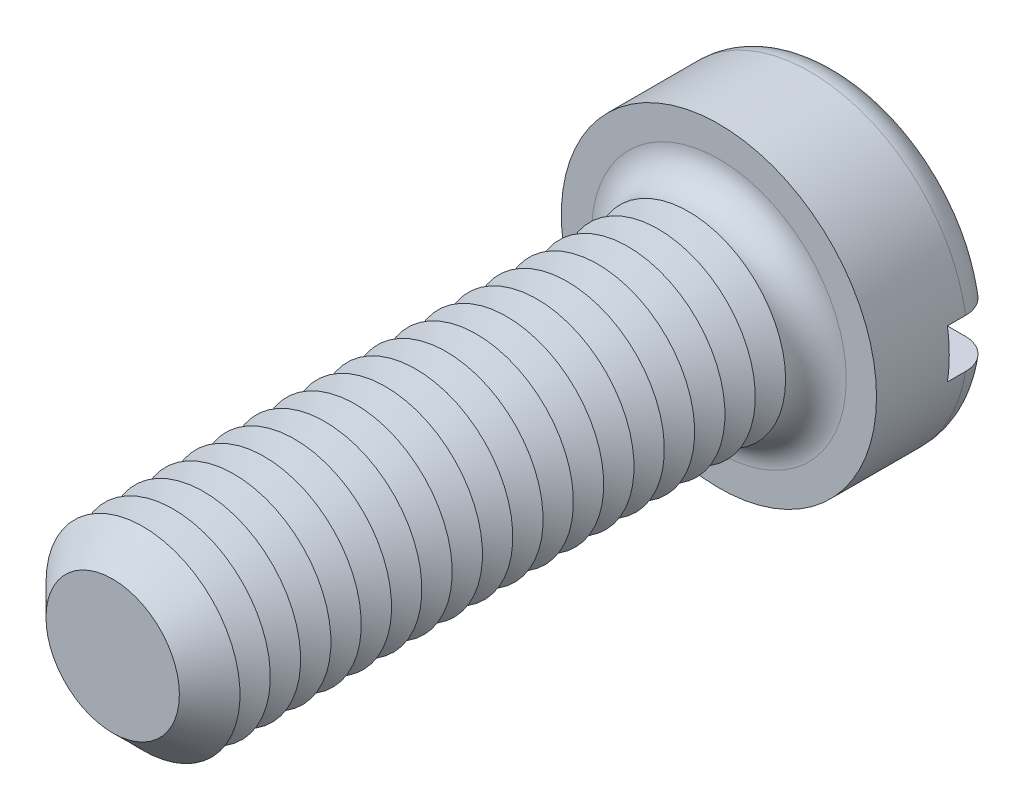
ISO-10303-21;
HEADER;
FILE_DESCRIPTION(('STEP AP214'),'2;1');
FILE_NAME('part.step','',(''),(''),'','','');
FILE_SCHEMA(('AUTOMOTIVE_DESIGN { 1 0 10303 214 1 1 1 1 }'));
ENDSEC;
DATA;
#1=APPLICATION_CONTEXT('core data for automotive mechanical design processes');
#2=APPLICATION_PROTOCOL_DEFINITION('international standard','automotive_design',2000,#1);
#3=PRODUCT_CONTEXT('',#1,'mechanical');
#4=PRODUCT('Part','Part','',(#3));
#5=PRODUCT_RELATED_PRODUCT_CATEGORY('part','',(#4));
#6=PRODUCT_DEFINITION_FORMATION('','',#4);
#7=PRODUCT_DEFINITION_CONTEXT('part definition',#1,'design');
#8=PRODUCT_DEFINITION('design','',#6,#7);
#9=PRODUCT_DEFINITION_SHAPE('','',#8);
#10=(LENGTH_UNIT() NAMED_UNIT(*) SI_UNIT(.MILLI.,.METRE.));
#11=(NAMED_UNIT(*) PLANE_ANGLE_UNIT() SI_UNIT($,.RADIAN.));
#12=(NAMED_UNIT(*) SI_UNIT($,.STERADIAN.) SOLID_ANGLE_UNIT());
#13=UNCERTAINTY_MEASURE_WITH_UNIT(LENGTH_MEASURE(1.E-05),#10,'distance_accuracy_value','');
#14=(GEOMETRIC_REPRESENTATION_CONTEXT(3) GLOBAL_UNCERTAINTY_ASSIGNED_CONTEXT((#13)) GLOBAL_UNIT_ASSIGNED_CONTEXT((#10,
#11,#12)) REPRESENTATION_CONTEXT('',''));
#15=CARTESIAN_POINT('',(0.,0.,0.));
#16=DIRECTION('',(0.,0.,1.));
#17=DIRECTION('',(1.,0.,0.));
#18=AXIS2_PLACEMENT_3D('',#15,#16,#17);
#19=CARTESIAN_POINT('',(0.,0.,-5.));
#20=DIRECTION('',(0.,0.,1.));
#21=DIRECTION('',(1.,0.,0.));
#22=AXIS2_PLACEMENT_3D('',#19,#20,#21);
#23=PLANE('',#22);
#24=CARTESIAN_POINT('',(0.,0.,-5.));
#25=DIRECTION('',(0.,0.,1.));
#26=DIRECTION('',(1.,0.,0.));
#27=AXIS2_PLACEMENT_3D('',#24,#25,#26);
#28=CIRCLE('',#27,5.25);
#29=CARTESIAN_POINT('',(-5.15388203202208,1.,-5.));
#30=VERTEX_POINT('',#29);
#31=CARTESIAN_POINT('',(5.15388203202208,1.,-5.));
#32=VERTEX_POINT('',#31);
#33=EDGE_CURVE('E116',#30,#32,#28,.F.);
#34=ORIENTED_EDGE('',*,*,#33,.T.);
#35=DIRECTION('',(1.,0.,0.));
#36=VECTOR('',#35,1.);
#37=CARTESIAN_POINT('',(-6.5,1.,-5.));
#38=LINE('',#37,#36);
#39=EDGE_CURVE('E111',#30,#32,#38,.T.);
#40=ORIENTED_EDGE('',*,*,#39,.F.);
#41=EDGE_LOOP('',(#34,#40));
#42=FACE_BOUND('',#41,.T.);
#43=ADVANCED_FACE('F39',(#42),#23,.F.);
#44=CARTESIAN_POINT('',(0.,0.,-3.75));
#45=DIRECTION('',(0.,0.,1.));
#46=DIRECTION('',(1.,0.,0.));
#47=AXIS2_PLACEMENT_3D('',#44,#45,#46);
#48=TOROIDAL_SURFACE('',#47,5.25,1.25);
#49=CARTESIAN_POINT('',(-6.04655789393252,1.,-4.63904490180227));
#50=CARTESIAN_POINT('',(-5.99546860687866,1.,-4.68885774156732));
#51=CARTESIAN_POINT('',(-5.94008472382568,1.,-4.73434760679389));
#52=CARTESIAN_POINT('',(-5.8223927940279,1.,-4.81538052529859));
#53=CARTESIAN_POINT('',(-5.7600753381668,1.,-4.85090982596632));
#54=CARTESIAN_POINT('',(-5.63044351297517,1.,-4.91100606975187));
#55=CARTESIAN_POINT('',(-5.56313479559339,1.,-4.93558519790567));
#56=CARTESIAN_POINT('',(-5.42539577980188,1.,-4.97322457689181));
#57=CARTESIAN_POINT('',(-5.35496625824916,1.,-4.98628767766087));
#58=CARTESIAN_POINT('',(-5.21212635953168,1.,-5.00070478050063));
#59=CARTESIAN_POINT('',(-5.13970265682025,1.,-5.00192674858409));
#60=CARTESIAN_POINT('',(-4.99565121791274,1.,-4.99234085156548));
#61=CARTESIAN_POINT('',(-4.92402357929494,1.,-4.98153152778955));
#62=CARTESIAN_POINT('',(-4.78274786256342,1.,-4.94801424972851));
#63=CARTESIAN_POINT('',(-4.71313137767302,1.,-4.92517296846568));
#64=CARTESIAN_POINT('',(-4.57871041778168,1.,-4.86813760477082));
#65=CARTESIAN_POINT('',(-4.51390612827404,1.,-4.83394308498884));
#66=CARTESIAN_POINT('',(-4.39095493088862,1.,-4.75508341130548));
#67=CARTESIAN_POINT('',(-4.33281197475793,1.,-4.7104120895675));
#68=CARTESIAN_POINT('',(-4.22499800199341,1.,-4.61179869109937));
#69=CARTESIAN_POINT('',(-4.17532640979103,1.,-4.55785724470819));
#70=CARTESIAN_POINT('',(-4.08677450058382,1.,-4.4431082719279));
#71=CARTESIAN_POINT('',(-4.0477350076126,1.,-4.38242369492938));
#72=CARTESIAN_POINT('',(-3.98074296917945,1.,-4.25521412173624));
#73=CARTESIAN_POINT('',(-3.95278836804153,1.,-4.18869021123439));
#74=CARTESIAN_POINT('',(-3.90959497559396,1.,-4.0537026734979));
#75=CARTESIAN_POINT('',(-3.89401985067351,1.,-3.98534663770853));
#76=CARTESIAN_POINT('',(-3.8748586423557,1.,-3.84697740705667));
#77=CARTESIAN_POINT('',(-3.87127067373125,1.,-3.7769644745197));
#78=CARTESIAN_POINT('',(-3.8761573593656,1.,-3.63892215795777));
#79=CARTESIAN_POINT('',(-3.88436651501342,1.,-3.57088319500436));
#80=CARTESIAN_POINT('',(-3.91207743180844,1.,-3.43714958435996));
#81=CARTESIAN_POINT('',(-3.93157911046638,1.,-3.37145491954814));
#82=CARTESIAN_POINT('',(-3.98125045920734,1.,-3.24411474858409));
#83=CARTESIAN_POINT('',(-4.01143761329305,1.,-3.18247607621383));
#84=CARTESIAN_POINT('',(-4.08150210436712,1.,-3.064981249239));
#85=CARTESIAN_POINT('',(-4.12138048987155,1.,-3.0091257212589));
#86=CARTESIAN_POINT('',(-4.2106718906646,1.,-2.90336353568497));
#87=CARTESIAN_POINT('',(-4.26028693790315,1.,-2.85362751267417));
#88=CARTESIAN_POINT('',(-4.36696587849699,1.,-2.76291710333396));
#89=CARTESIAN_POINT('',(-4.42403082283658,1.,-2.72194395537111));
#90=CARTESIAN_POINT('',(-4.54567957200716,1.,-2.64877280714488));
#91=CARTESIAN_POINT('',(-4.61042643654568,1.,-2.61684571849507));
#92=CARTESIAN_POINT('',(-4.74430563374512,1.,-2.56412359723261));
#93=CARTESIAN_POINT('',(-4.81343838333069,1.,-2.54332962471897));
#94=CARTESIAN_POINT('',(-4.95527237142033,1.,-2.51320471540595));
#95=CARTESIAN_POINT('',(-5.0280120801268,1.,-2.50405449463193));
#96=CARTESIAN_POINT('',(-5.17399775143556,1.,-2.49810126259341));
#97=CARTESIAN_POINT('',(-5.24724372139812,1.,-2.50129843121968));
#98=CARTESIAN_POINT('',(-5.3921014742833,1.,-2.52000776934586));
#99=CARTESIAN_POINT('',(-5.4637142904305,1.,-2.53551191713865));
#100=CARTESIAN_POINT('',(-5.60326680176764,1.,-2.57846304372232));
#101=CARTESIAN_POINT('',(-5.67120668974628,1.,-2.60590939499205));
#102=CARTESIAN_POINT('',(-5.80064060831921,1.,-2.67164926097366));
#103=CARTESIAN_POINT('',(-5.862199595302,1.,-2.7098148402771));
#104=CARTESIAN_POINT('',(-5.9779079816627,1.,-2.79608690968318));
#105=CARTESIAN_POINT('',(-6.03205795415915,1.,-2.84419263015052));
#106=CARTESIAN_POINT('',(-6.13055119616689,1.,-2.94820522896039));
#107=CARTESIAN_POINT('',(-6.17502887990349,1.,-3.00398483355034));
#108=CARTESIAN_POINT('',(-6.25384180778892,1.,-3.12230113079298));
#109=CARTESIAN_POINT('',(-6.28817779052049,1.,-3.18483733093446));
#110=CARTESIAN_POINT('',(-6.34527986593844,1.,-3.31401726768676));
#111=CARTESIAN_POINT('',(-6.36818984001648,1.,-3.38059742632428));
#112=CARTESIAN_POINT('',(-6.40240470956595,1.,-3.5166725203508));
#113=CARTESIAN_POINT('',(-6.41371067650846,1.,-3.58616718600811));
#114=CARTESIAN_POINT('',(-6.42433240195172,1.,-3.72550026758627));
#115=CARTESIAN_POINT('',(-6.4237441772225,1.,-3.79533138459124));
#116=CARTESIAN_POINT('',(-6.41082814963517,1.,-3.93391789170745));
#117=CARTESIAN_POINT('',(-6.39849757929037,1.,-4.00267302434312));
#118=CARTESIAN_POINT('',(-6.36249191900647,1.,-4.13704597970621));
#119=CARTESIAN_POINT('',(-6.33883072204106,1.,-4.20266753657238));
#120=CARTESIAN_POINT('',(-6.28088769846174,1.,-4.32897165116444));
#121=CARTESIAN_POINT('',(-6.24661890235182,1.,-4.38966015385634));
#122=CARTESIAN_POINT('',(-6.18404039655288,1.,-4.48163773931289));
#123=CARTESIAN_POINT('',(-6.15876600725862,1.,-4.51503333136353));
#124=CARTESIAN_POINT('',(-6.10500607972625,1.,-4.5791298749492));
#125=CARTESIAN_POINT('',(-6.07652056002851,1.,-4.60983084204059));
#126=CARTESIAN_POINT('',(-6.04655789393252,1.,-4.63904490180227));
#127=B_SPLINE_CURVE_WITH_KNOTS('',3,(#49,#50,#51,#52,#53,#54,#55,#56,#57,#58,#59,#60,#61,#62,
#63,#64,#65,#66,#67,#68,#69,#70,#71,#72,#73,#74,#75,#76,#77,#78,#79,#80,#81,#82,#83,#84,#85,#86,
#87,#88,#89,#90,#91,#92,#93,#94,#95,#96,#97,#98,#99,#100,#101,#102,#103,#104,#105,#106,#107,
#108,#109,#110,#111,#112,#113,#114,#115,#116,#117,#118,#119,#120,#121,#122,#123,#124,#125,#126),
.UNSPECIFIED.,.T.,.F.,(4,2,2,2,2,2,2,2,2,2,2,2,2,2,2,2,2,2,2,2,2,2,2,2,2,2,2,2,2,2,2,2,2,2,2,2,
2,2,4),(0.,0.213907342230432,0.428108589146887,0.642070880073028,0.855980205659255,
1.07227200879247,1.28859003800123,1.50735715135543,1.72613269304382,1.94503735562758,
2.16392713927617,2.37933295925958,2.59469881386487,2.80399176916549,3.01325180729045,
3.2178754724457,3.42249764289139,3.62745618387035,3.83243690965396,4.04223444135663,
4.25206160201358,4.46763253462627,4.68322399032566,4.90212226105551,5.12102372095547,
5.33978261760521,5.55853002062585,5.77477015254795,5.99099354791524,6.20398686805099,
6.41696467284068,6.62718821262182,6.83739233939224,7.0459002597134,7.25445733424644,
7.46275934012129,7.67080647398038,7.79625882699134,7.92171045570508),.UNSPECIFIED.);
#128=CARTESIAN_POINT('',(-6.42261628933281,1.,-3.74999999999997));
#129=VERTEX_POINT('',#128);
#130=EDGE_CURVE('E322',#129,#30,#127,.T.);
#131=ORIENTED_EDGE('',*,*,#130,.F.);
#132=CARTESIAN_POINT('',(0.,0.,-3.75));
#133=DIRECTION('',(0.,0.,1.));
#134=DIRECTION('',(1.,0.,0.));
#135=AXIS2_PLACEMENT_3D('',#132,#133,#134);
#136=CIRCLE('',#135,6.5);
#137=CARTESIAN_POINT('',(6.42261628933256,1.,-3.75));
#138=VERTEX_POINT('',#137);
#139=EDGE_CURVE('E124',#138,#129,#136,.T.);
#140=ORIENTED_EDGE('',*,*,#139,.F.);
#141=CARTESIAN_POINT('',(4.06944999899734,1.,-4.4133199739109));
#142=CARTESIAN_POINT('',(4.10828271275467,1.,-4.47354709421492));
#143=CARTESIAN_POINT('',(4.15233880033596,1.,-4.53047894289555));
#144=CARTESIAN_POINT('',(4.24946916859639,1.,-4.63614530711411));
#145=CARTESIAN_POINT('',(4.3025574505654,1.,-4.68486685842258));
#146=CARTESIAN_POINT('',(4.41603250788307,1.,-4.77271114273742));
#147=CARTESIAN_POINT('',(4.47640839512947,1.,-4.8118479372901));
#148=CARTESIAN_POINT('',(4.60277035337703,1.,-4.87959878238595));
#149=CARTESIAN_POINT('',(4.66875480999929,1.,-4.90821584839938));
#150=CARTESIAN_POINT('',(4.80558589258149,1.,-4.95456537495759));
#151=CARTESIAN_POINT('',(4.87649196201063,1.,-4.97212253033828));
#152=CARTESIAN_POINT('',(5.02024710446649,1.,-4.99514979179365));
#153=CARTESIAN_POINT('',(5.09309636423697,1.,-5.00061873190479));
#154=CARTESIAN_POINT('',(5.23902872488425,1.,-4.99926689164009));
#155=CARTESIAN_POINT('',(5.31211131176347,1.,-4.99238812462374));
#156=CARTESIAN_POINT('',(5.45605806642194,1.,-4.96635140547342));
#157=CARTESIAN_POINT('',(5.52692231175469,1.,-4.94719388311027));
#158=CARTESIAN_POINT('',(5.66376170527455,1.,-4.89728421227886));
#159=CARTESIAN_POINT('',(5.72977335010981,1.,-4.86663219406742));
#160=CARTESIAN_POINT('',(5.85560715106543,1.,-4.79452334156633));
#161=CARTESIAN_POINT('',(5.91542977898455,1.,-4.7530673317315));
#162=CARTESIAN_POINT('',(6.02626022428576,1.,-4.66116821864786));
#163=CARTESIAN_POINT('',(6.07738307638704,1.,-4.6108638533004));
#164=CARTESIAN_POINT('',(6.17030947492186,1.,-4.50227823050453));
#165=CARTESIAN_POINT('',(6.2121137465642,1.,-4.44399759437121));
#166=CARTESIAN_POINT('',(6.28460268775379,1.,-4.32200305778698));
#167=CARTESIAN_POINT('',(6.31543589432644,1.,-4.2583773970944));
#168=CARTESIAN_POINT('',(6.36586009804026,1.,-4.12681721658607));
#169=CARTESIAN_POINT('',(6.38545178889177,1.,-4.0588829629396));
#170=CARTESIAN_POINT('',(6.41265760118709,1.,-3.92136007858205));
#171=CARTESIAN_POINT('',(6.42038873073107,1.,-3.85179457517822));
#172=CARTESIAN_POINT('',(6.42401070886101,1.,-3.7123569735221));
#173=CARTESIAN_POINT('',(6.41990193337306,1.,-3.64248488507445));
#174=CARTESIAN_POINT('',(6.40000894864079,1.,-3.50470871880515));
#175=CARTESIAN_POINT('',(6.38427119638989,1.,-3.43679792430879));
#176=CARTESIAN_POINT('',(6.34164491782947,1.,-3.30457296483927));
#177=CARTESIAN_POINT('',(6.31475638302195,1.,-3.24025880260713));
#178=CARTESIAN_POINT('',(6.2505455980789,1.,-3.11686791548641));
#179=CARTESIAN_POINT('',(6.21319759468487,1.,-3.05780459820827));
#180=CARTESIAN_POINT('',(6.12919411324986,1.,-2.94671919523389));
#181=CARTESIAN_POINT('',(6.08253833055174,1.,-2.89469734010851));
#182=CARTESIAN_POINT('',(5.98083387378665,1.,-2.79868150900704));
#183=CARTESIAN_POINT('',(5.92571704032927,1.,-2.75475975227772));
#184=CARTESIAN_POINT('',(5.80897194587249,1.,-2.67665277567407));
#185=CARTESIAN_POINT('',(5.74734329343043,1.,-2.64246814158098));
#186=CARTESIAN_POINT('',(5.6184644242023,1.,-2.58431810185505));
#187=CARTESIAN_POINT('',(5.55115102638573,1.,-2.56049275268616));
#188=CARTESIAN_POINT('',(5.41351272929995,1.,-2.52429868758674));
#189=CARTESIAN_POINT('',(5.34318759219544,1.,-2.51193087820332));
#190=CARTESIAN_POINT('',(5.20041507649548,1.,-2.49882112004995));
#191=CARTESIAN_POINT('',(5.12795169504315,1.,-2.49825332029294));
#192=CARTESIAN_POINT('',(4.98393373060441,1.,-2.50914771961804));
#193=CARTESIAN_POINT('',(4.91237921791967,1.,-2.52061084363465));
#194=CARTESIAN_POINT('',(4.77137358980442,1.,-2.55542281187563));
#195=CARTESIAN_POINT('',(4.70195472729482,1.,-2.57890245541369));
#196=CARTESIAN_POINT('',(4.56803538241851,1.,-2.63717701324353));
#197=CARTESIAN_POINT('',(4.50353509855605,1.,-2.67197238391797));
#198=CARTESIAN_POINT('',(4.38131858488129,1.,-2.7519648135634));
#199=CARTESIAN_POINT('',(4.32360365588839,1.,-2.79716386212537));
#200=CARTESIAN_POINT('',(4.21673400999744,1.,-2.89675634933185));
#201=CARTESIAN_POINT('',(4.16757871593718,1.,-2.95114916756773));
#202=CARTESIAN_POINT('',(4.08014713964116,1.,-3.06667703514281));
#203=CARTESIAN_POINT('',(4.04170608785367,1.,-3.12768727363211));
#204=CARTESIAN_POINT('',(3.97596192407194,1.,-3.25543782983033));
#205=CARTESIAN_POINT('',(3.94865624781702,1.,-3.32217682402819));
#206=CARTESIAN_POINT('',(3.9067737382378,1.,-3.45745603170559));
#207=CARTESIAN_POINT('',(3.89185707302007,1.,-3.52589108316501));
#208=CARTESIAN_POINT('',(3.87400755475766,1.,-3.66432360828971));
#209=CARTESIAN_POINT('',(3.87107601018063,1.,-3.73432125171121));
#210=CARTESIAN_POINT('',(3.8772387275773,1.,-3.87228267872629));
#211=CARTESIAN_POINT('',(3.88607933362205,1.,-3.94025811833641));
#212=CARTESIAN_POINT('',(3.91502769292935,1.,-4.07370133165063));
#213=CARTESIAN_POINT('',(3.93512131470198,1.,-4.1391721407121));
#214=CARTESIAN_POINT('',(3.9752037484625,1.,-4.23926719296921));
#215=CARTESIAN_POINT('',(3.99171171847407,1.,-4.27532618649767));
#216=CARTESIAN_POINT('',(4.02809737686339,1.,-4.34569933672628));
#217=CARTESIAN_POINT('',(4.04797497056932,1.,-4.3800135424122));
#218=CARTESIAN_POINT('',(4.06944999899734,1.,-4.4133199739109));
#219=B_SPLINE_CURVE_WITH_KNOTS('',3,(#141,#142,#143,#144,#145,#146,#147,#148,#149,#150,#151,
#152,#153,#154,#155,#156,#157,#158,#159,#160,#161,#162,#163,#164,#165,#166,#167,#168,#169,#170,
#171,#172,#173,#174,#175,#176,#177,#178,#179,#180,#181,#182,#183,#184,#185,#186,#187,#188,#189,
#190,#191,#192,#193,#194,#195,#196,#197,#198,#199,#200,#201,#202,#203,#204,#205,#206,#207,#208,
#209,#210,#211,#212,#213,#214,#215,#216,#217,#218),.UNSPECIFIED.,.T.,.F.,(4,2,2,2,2,2,2,2,2,2,2,
2,2,2,2,2,2,2,2,2,2,2,2,2,2,2,2,2,2,2,2,2,2,2,2,2,2,2,4),(0.,0.214833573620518,
0.430003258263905,0.644855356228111,0.859645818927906,1.0777603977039,1.29589601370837,
1.51505870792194,1.73421373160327,1.95150241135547,2.16877451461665,2.38290237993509,
2.59701357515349,2.8081044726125,3.01918234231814,3.22816416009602,3.43713934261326,
3.64528416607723,3.85342914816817,4.06209119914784,4.27076008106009,4.48120788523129,
4.69166834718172,4.90489186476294,5.11813225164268,5.33451752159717,5.55091942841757,
5.76972860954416,5.98854661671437,6.20740650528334,6.42625163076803,6.64151774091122,
6.85673425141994,7.0658317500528,7.27495207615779,7.47963858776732,7.68406862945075,
7.80287790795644,7.92168384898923),.UNSPECIFIED.);
#220=EDGE_CURVE('E324',#32,#138,#219,.T.);
#221=ORIENTED_EDGE('',*,*,#220,.F.);
#222=ORIENTED_EDGE('',*,*,#33,.F.);
#223=EDGE_LOOP('',(#131,#140,#221,#222));
#224=FACE_BOUND('',#223,.T.);
#225=ADVANCED_FACE('F306',(#224),#48,.T.);
#226=CARTESIAN_POINT('',(0.,0.,-5.));
#227=DIRECTION('',(0.,0.,1.));
#228=DIRECTION('',(1.,0.,0.));
#229=AXIS2_PLACEMENT_3D('',#226,#227,#228);
#230=CYLINDRICAL_SURFACE('',#229,6.5);
#231=DIRECTION('',(0.,0.,1.));
#232=VECTOR('',#231,1.);
#233=CARTESIAN_POINT('',(6.42261628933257,1.,-5.));
#234=LINE('',#233,#232);
#235=CARTESIAN_POINT('',(6.42261628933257,1.,-3.));
#236=VERTEX_POINT('',#235);
#237=EDGE_CURVE('E340',#138,#236,#234,.T.);
#238=ORIENTED_EDGE('',*,*,#237,.F.);
#239=ORIENTED_EDGE('',*,*,#139,.T.);
#240=DIRECTION('',(0.,0.,1.));
#241=VECTOR('',#240,1.);
#242=CARTESIAN_POINT('',(-6.42261628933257,1.,-5.));
#243=LINE('',#242,#241);
#244=CARTESIAN_POINT('',(-6.42261628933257,1.,-3.));
#245=VERTEX_POINT('',#244);
#246=EDGE_CURVE('E63',#245,#129,#243,.F.);
#247=ORIENTED_EDGE('',*,*,#246,.F.);
#248=CARTESIAN_POINT('',(0.,0.,-3.));
#249=DIRECTION('',(0.,0.,-1.));
#250=DIRECTION('',(-1.,0.,0.));
#251=AXIS2_PLACEMENT_3D('',#248,#249,#250);
#252=CIRCLE('',#251,6.5);
#253=CARTESIAN_POINT('',(-6.42261628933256,-0.999999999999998,-3.));
#254=VERTEX_POINT('',#253);
#255=EDGE_CURVE('E43',#245,#254,#252,.F.);
#256=ORIENTED_EDGE('',*,*,#255,.T.);
#257=DIRECTION('',(0.,0.,1.));
#258=VECTOR('',#257,1.);
#259=CARTESIAN_POINT('',(-6.42261628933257,-0.999999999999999,-5.));
#260=LINE('',#259,#258);
#261=CARTESIAN_POINT('',(-6.42261628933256,-0.999999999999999,-3.75));
#262=VERTEX_POINT('',#261);
#263=EDGE_CURVE('E337',#262,#254,#260,.T.);
#264=ORIENTED_EDGE('',*,*,#263,.F.);
#265=CARTESIAN_POINT('',(6.42261628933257,-1.,-3.75));
#266=VERTEX_POINT('',#265);
#267=EDGE_CURVE('E126',#262,#266,#136,.T.);
#268=ORIENTED_EDGE('',*,*,#267,.T.);
#269=DIRECTION('',(0.,0.,1.));
#270=VECTOR('',#269,1.);
#271=CARTESIAN_POINT('',(6.42261628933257,-1.,-5.));
#272=LINE('',#271,#270);
#273=CARTESIAN_POINT('',(6.42261628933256,-1.,-3.));
#274=VERTEX_POINT('',#273);
#275=EDGE_CURVE('E55',#274,#266,#272,.F.);
#276=ORIENTED_EDGE('',*,*,#275,.F.);
#277=EDGE_CURVE('E11',#274,#236,#252,.F.);
#278=ORIENTED_EDGE('',*,*,#277,.T.);
#279=EDGE_LOOP('',(#238,#239,#247,#256,#264,#268,#276,#278));
#280=FACE_BOUND('',#279,.T.);
#281=CARTESIAN_POINT('',(0.,0.,0.));
#282=DIRECTION('',(0.,0.,1.));
#283=DIRECTION('',(1.,0.,0.));
#284=AXIS2_PLACEMENT_3D('',#281,#282,#283);
#285=CIRCLE('',#284,6.5);
#286=CARTESIAN_POINT('',(6.5,0.,0.));
#287=VERTEX_POINT('',#286);
#288=EDGE_CURVE('E342',#287,#287,#285,.T.);
#289=ORIENTED_EDGE('',*,*,#288,.F.);
#290=EDGE_LOOP('',(#289));
#291=FACE_BOUND('',#290,.T.);
#292=ADVANCED_FACE('F302',(#280,#291),#230,.T.);
#293=CARTESIAN_POINT('',(5.15388203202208,-1.,-5.));
#294=VERTEX_POINT('',#293);
#295=CARTESIAN_POINT('',(-5.15388203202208,-0.999999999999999,-5.));
#296=VERTEX_POINT('',#295);
#297=EDGE_CURVE('E109',#294,#296,#28,.F.);
#298=ORIENTED_EDGE('',*,*,#297,.T.);
#299=DIRECTION('',(-1.,0.,0.));
#300=VECTOR('',#299,1.);
#301=CARTESIAN_POINT('',(-6.5,-0.999999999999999,-5.));
#302=LINE('',#301,#300);
#303=EDGE_CURVE('E96',#294,#296,#302,.T.);
#304=ORIENTED_EDGE('',*,*,#303,.F.);
#305=EDGE_LOOP('',(#298,#304));
#306=FACE_BOUND('',#305,.T.);
#307=ADVANCED_FACE('F108',(#306),#23,.F.);
#308=CARTESIAN_POINT('',(0.,0.,0.));
#309=DIRECTION('',(0.,0.,1.));
#310=DIRECTION('',(1.,0.,0.));
#311=AXIS2_PLACEMENT_3D('',#308,#309,#310);
#312=PLANE('',#311);
#313=CARTESIAN_POINT('',(0.,0.,0.));
#314=DIRECTION('',(0.,0.,1.));
#315=DIRECTION('',(1.,0.,0.));
#316=AXIS2_PLACEMENT_3D('',#313,#314,#315);
#317=CIRCLE('',#316,5.25);
#318=CARTESIAN_POINT('',(5.25,0.,0.));
#319=VERTEX_POINT('',#318);
#320=EDGE_CURVE('E115',#319,#319,#317,.F.);
#321=ORIENTED_EDGE('',*,*,#320,.T.);
#322=EDGE_LOOP('',(#321));
#323=FACE_BOUND('',#322,.T.);
#324=ORIENTED_EDGE('',*,*,#288,.T.);
#325=EDGE_LOOP('',(#324));
#326=FACE_BOUND('',#325,.T.);
#327=ADVANCED_FACE('F301',(#323,#326),#312,.T.);
#328=CARTESIAN_POINT('',(-6.04655789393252,-0.999999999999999,-4.63904490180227));
#329=CARTESIAN_POINT('',(-6.0966604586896,-0.999999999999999,-4.59018532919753));
#330=CARTESIAN_POINT('',(-6.14270501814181,-0.999999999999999,-4.53709744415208));
#331=CARTESIAN_POINT('',(-6.22528519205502,-0.999999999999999,-4.42391631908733));
#332=CARTESIAN_POINT('',(-6.26181074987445,-0.999999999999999,-4.36381576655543));
#333=CARTESIAN_POINT('',(-6.32422109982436,-0.999999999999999,-4.23831836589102));
#334=CARTESIAN_POINT('',(-6.35010658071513,-0.999999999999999,-4.17292186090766));
#335=CARTESIAN_POINT('',(-6.39044668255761,-0.999999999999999,-4.03870925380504));
#336=CARTESIAN_POINT('',(-6.40490396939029,-0.999999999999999,-3.96989395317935));
#337=CARTESIAN_POINT('',(-6.42190814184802,-0.999999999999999,-3.83122595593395));
#338=CARTESIAN_POINT('',(-6.4245257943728,-0.999999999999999,-3.76138193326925));
#339=CARTESIAN_POINT('',(-6.41796432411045,-0.999999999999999,-3.62224935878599));
#340=CARTESIAN_POINT('',(-6.40878509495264,-0.999999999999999,-3.55296081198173));
#341=CARTESIAN_POINT('',(-6.37894560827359,-0.999999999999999,-3.41709241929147));
#342=CARTESIAN_POINT('',(-6.35831520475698,-0.999999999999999,-3.35050601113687));
#343=CARTESIAN_POINT('',(-6.30620980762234,-0.999999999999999,-3.22172312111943));
#344=CARTESIAN_POINT('',(-6.2747347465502,-0.999999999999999,-3.15952666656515));
#345=CARTESIAN_POINT('',(-6.20172710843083,-0.999999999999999,-3.04101762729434));
#346=CARTESIAN_POINT('',(-6.16015622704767,-0.999999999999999,-2.98472864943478));
#347=CARTESIAN_POINT('',(-6.06823774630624,-0.999999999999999,-2.87984578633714));
#348=CARTESIAN_POINT('',(-6.01788981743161,-0.999999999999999,-2.83125219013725));
#349=CARTESIAN_POINT('',(-5.90933830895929,-0.999999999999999,-2.74262118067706));
#350=CARTESIAN_POINT('',(-5.85106338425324,-0.999999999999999,-2.70267117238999));
#351=CARTESIAN_POINT('',(-5.72870702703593,-0.999999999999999,-2.63296796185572));
#352=CARTESIAN_POINT('',(-5.66462521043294,-0.999999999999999,-2.6032154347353));
#353=CARTESIAN_POINT('',(-5.53153273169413,-0.999999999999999,-2.55430842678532));
#354=CARTESIAN_POINT('',(-5.46246626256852,-0.999999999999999,-2.53530583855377));
#355=CARTESIAN_POINT('',(-5.32214267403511,-0.999999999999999,-2.5089831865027));
#356=CARTESIAN_POINT('',(-5.25088537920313,-0.999999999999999,-2.50166406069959));
#357=CARTESIAN_POINT('',(-5.10710123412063,-0.999999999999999,-2.49882202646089));
#358=CARTESIAN_POINT('',(-5.03457095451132,-0.999999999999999,-2.50347166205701));
#359=CARTESIAN_POINT('',(-4.8912897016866,-0.999999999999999,-2.52476029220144));
#360=CARTESIAN_POINT('',(-4.82053886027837,-0.999999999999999,-2.54140017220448));
#361=CARTESIAN_POINT('',(-4.68213257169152,-0.999999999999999,-2.58641614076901));
#362=CARTESIAN_POINT('',(-4.61451256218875,-0.999999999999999,-2.61490131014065));
#363=CARTESIAN_POINT('',(-4.48502801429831,-0.999999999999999,-2.68285095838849));
#364=CARTESIAN_POINT('',(-4.42316359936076,-0.999999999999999,-2.72231567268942));
#365=CARTESIAN_POINT('',(-4.30720694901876,-0.999999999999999,-2.81103994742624));
#366=CARTESIAN_POINT('',(-4.25309118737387,-0.999999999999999,-2.86026872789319));
#367=CARTESIAN_POINT('',(-4.15409408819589,-0.999999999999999,-2.9672764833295));
#368=CARTESIAN_POINT('',(-4.10921182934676,-0.999999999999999,-3.02505460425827));
#369=CARTESIAN_POINT('',(-4.03096584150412,-0.999999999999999,-3.14632492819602));
#370=CARTESIAN_POINT('',(-3.99739097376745,-0.999999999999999,-3.2096807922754));
#371=CARTESIAN_POINT('',(-3.94171839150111,-0.999999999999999,-3.34124912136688));
#372=CARTESIAN_POINT('',(-3.91961840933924,-0.999999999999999,-3.40946062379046));
#373=CARTESIAN_POINT('',(-3.88816636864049,-0.999999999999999,-3.54669256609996));
#374=CARTESIAN_POINT('',(-3.87846562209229,-0.999999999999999,-3.61563318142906));
#375=CARTESIAN_POINT('',(-3.87100568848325,-0.999999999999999,-3.75415397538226));
#376=CARTESIAN_POINT('',(-3.87324501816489,-0.999999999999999,-3.82373407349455));
#377=CARTESIAN_POINT('',(-3.88943589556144,-0.999999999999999,-3.96027701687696));
#378=CARTESIAN_POINT('',(-3.90318225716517,-0.999999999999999,-4.0272643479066));
#379=CARTESIAN_POINT('',(-3.94163954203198,-0.999999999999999,-4.1580093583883));
#380=CARTESIAN_POINT('',(-3.96635075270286,-0.999999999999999,-4.22176695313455));
#381=CARTESIAN_POINT('',(-4.026160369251,-0.999999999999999,-4.34483320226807));
#382=CARTESIAN_POINT('',(-4.06134035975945,-0.999999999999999,-4.40410214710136));
#383=CARTESIAN_POINT('',(-4.14090865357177,-0.999999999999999,-4.51609417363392));
#384=CARTESIAN_POINT('',(-4.18529811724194,-0.999999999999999,-4.56881642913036));
#385=CARTESIAN_POINT('',(-4.2832649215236,-0.999999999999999,-4.66770177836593));
#386=CARTESIAN_POINT('',(-4.33705327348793,-0.999999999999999,-4.71365579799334));
#387=CARTESIAN_POINT('',(-4.45141776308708,-0.999999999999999,-4.79615385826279));
#388=CARTESIAN_POINT('',(-4.51199483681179,-0.999999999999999,-4.83269659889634));
#389=CARTESIAN_POINT('',(-4.63989216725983,-0.999999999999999,-4.89626962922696));
#390=CARTESIAN_POINT('',(-4.70734508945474,-0.999999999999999,-4.92303326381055));
#391=CARTESIAN_POINT('',(-4.84575497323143,-0.999999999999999,-4.96500199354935));
#392=CARTESIAN_POINT('',(-4.91671207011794,-0.999999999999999,-4.98020664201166));
#393=CARTESIAN_POINT('',(-5.06097761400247,-0.999999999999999,-4.9987306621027));
#394=CARTESIAN_POINT('',(-5.13430353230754,-0.999999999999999,-5.00191441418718));
#395=CARTESIAN_POINT('',(-5.28046546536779,-0.999999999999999,-4.99587686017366));
#396=CARTESIAN_POINT('',(-5.35330135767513,-0.999999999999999,-4.98665256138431));
#397=CARTESIAN_POINT('',(-5.49610354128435,-0.999999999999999,-4.95604184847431));
#398=CARTESIAN_POINT('',(-5.56607890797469,-0.999999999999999,-4.93469772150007));
#399=CARTESIAN_POINT('',(-5.70131538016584,-0.999999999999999,-4.88041956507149));
#400=CARTESIAN_POINT('',(-5.76658233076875,-0.999999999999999,-4.84750021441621));
#401=CARTESIAN_POINT('',(-5.86782577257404,-0.999999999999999,-4.78498748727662));
#402=CARTESIAN_POINT('',(-5.90579749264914,-0.999999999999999,-4.75856648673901));
#403=CARTESIAN_POINT('',(-5.97862186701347,-0.999999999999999,-4.70172646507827));
#404=CARTESIAN_POINT('',(-6.0134745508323,-0.999999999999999,-4.6713074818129));
#405=CARTESIAN_POINT('',(-6.04655789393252,-0.999999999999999,-4.63904490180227));
#406=B_SPLINE_CURVE_WITH_KNOTS('',3,(#328,#329,#330,#331,#332,#333,#334,#335,#336,#337,#338,
#339,#340,#341,#342,#343,#344,#345,#346,#347,#348,#349,#350,#351,#352,#353,#354,#355,#356,#357,
#358,#359,#360,#361,#362,#363,#364,#365,#366,#367,#368,#369,#370,#371,#372,#373,#374,#375,#376,
#377,#378,#379,#380,#381,#382,#383,#384,#385,#386,#387,#388,#389,#390,#391,#392,#393,#394,#395,
#396,#397,#398,#399,#400,#401,#402,#403,#404,#405),.UNSPECIFIED.,.T.,.F.,(4,2,2,2,2,2,2,2,2,2,2,
2,2,2,2,2,2,2,2,2,2,2,2,2,2,2,2,2,2,2,2,2,2,2,2,2,2,2,4),(0.,0.209780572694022,
0.419781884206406,0.629769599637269,0.839708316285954,1.04839053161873,1.2570746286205,
1.46521720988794,1.67336108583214,1.88230736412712,2.09126148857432,2.30223890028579,
2.51323027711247,2.72713284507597,2.94105258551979,3.15807345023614,3.37511034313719,
3.59419176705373,3.81327788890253,4.03168404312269,4.25006839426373,4.46411376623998,
4.67811682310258,4.88595885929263,5.09377507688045,5.29796268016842,5.50215563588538,
5.70798353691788,5.91383738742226,6.12510741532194,6.33640661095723,6.55309998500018,
6.76980173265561,6.98894112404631,7.20813337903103,7.42656551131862,7.64472163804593,
7.78324365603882,7.92176436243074),.UNSPECIFIED.);
#407=EDGE_CURVE('E103',#296,#262,#406,.T.);
#408=ORIENTED_EDGE('',*,*,#407,.F.);
#409=ORIENTED_EDGE('',*,*,#297,.F.);
#410=CARTESIAN_POINT('',(4.06944999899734,-1.,-4.4133199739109));
#411=CARTESIAN_POINT('',(4.03213207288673,-1.,-4.3554312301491));
#412=CARTESIAN_POINT('',(3.9995849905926,-1.,-4.29441722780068));
#413=CARTESIAN_POINT('',(3.94511822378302,-1.,-4.16776604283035));
#414=CARTESIAN_POINT('',(3.92320762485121,-1.,-4.10212496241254));
#415=CARTESIAN_POINT('',(3.89078811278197,-1.,-3.96804412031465));
#416=CARTESIAN_POINT('',(3.88028409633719,-1.,-3.89960316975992));
#417=CARTESIAN_POINT('',(3.87107895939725,-1.,-3.76194650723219));
#418=CARTESIAN_POINT('',(3.87237511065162,-1.,-3.69273097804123));
#419=CARTESIAN_POINT('',(3.88662927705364,-1.,-3.55634460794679));
#420=CARTESIAN_POINT('',(3.89944923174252,-1.,-3.48915926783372));
#421=CARTESIAN_POINT('',(3.93611188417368,-1.,-3.35786953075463));
#422=CARTESIAN_POINT('',(3.95995518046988,-1.,-3.29376530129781));
#423=CARTESIAN_POINT('',(4.0180748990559,-1.,-3.16993562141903));
#424=CARTESIAN_POINT('',(4.05242297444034,-1.,-3.11024385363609));
#425=CARTESIAN_POINT('',(4.13041121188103,-1.,-2.9972793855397));
#426=CARTESIAN_POINT('',(4.17405248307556,-1.,-2.94400745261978));
#427=CARTESIAN_POINT('',(4.27058636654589,-1.,-2.8439150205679));
#428=CARTESIAN_POINT('',(4.32368948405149,-1.,-2.79729757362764));
#429=CARTESIAN_POINT('',(4.43679856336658,-1.,-2.71336600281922));
#430=CARTESIAN_POINT('',(4.49680546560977,-1.,-2.67605314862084));
#431=CARTESIAN_POINT('',(4.62370121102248,-1.,-2.61081752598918));
#432=CARTESIAN_POINT('',(4.69072799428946,-1.,-2.58316284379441));
#433=CARTESIAN_POINT('',(4.82843981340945,-1.,-2.5393441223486));
#434=CARTESIAN_POINT('',(4.899125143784,-1.,-2.52318100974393));
#435=CARTESIAN_POINT('',(5.04306377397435,-1.,-2.50267755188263));
#436=CARTESIAN_POINT('',(5.11633773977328,-1.,-2.49848181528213));
#437=CARTESIAN_POINT('',(5.26254809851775,-1.,-2.50249357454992));
#438=CARTESIAN_POINT('',(5.33548449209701,-1.,-2.51070104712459));
#439=CARTESIAN_POINT('',(5.4786703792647,-1.,-2.53930888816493));
#440=CARTESIAN_POINT('',(5.54892819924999,-1.,-2.5596675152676));
#441=CARTESIAN_POINT('',(5.68495799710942,-1.,-2.61204238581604));
#442=CARTESIAN_POINT('',(5.75073024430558,-1.,-2.64405792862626));
#443=CARTESIAN_POINT('',(5.8750178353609,-1.,-2.7184150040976));
#444=CARTESIAN_POINT('',(5.93361487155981,-1.,-2.76061995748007));
#445=CARTESIAN_POINT('',(6.04275377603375,-1.,-2.85440601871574));
#446=CARTESIAN_POINT('',(6.09329629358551,-1.,-2.90598637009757));
#447=CARTESIAN_POINT('',(6.18409572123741,-1.,-3.01622977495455));
#448=CARTESIAN_POINT('',(6.2244945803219,-1.,-3.07477592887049));
#449=CARTESIAN_POINT('',(6.29474798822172,-1.,-3.19788594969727));
#450=CARTESIAN_POINT('',(6.3246032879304,-1.,-3.26244938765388));
#451=CARTESIAN_POINT('',(6.37256001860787,-1.,-3.39491634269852));
#452=CARTESIAN_POINT('',(6.39079949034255,-1.,-3.46276990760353));
#453=CARTESIAN_POINT('',(6.41554133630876,-1.,-3.60058363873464));
#454=CARTESIAN_POINT('',(6.42204424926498,-1.,-3.67054370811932));
#455=CARTESIAN_POINT('',(6.42311237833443,-1.,-3.81007982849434));
#456=CARTESIAN_POINT('',(6.41775799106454,-1.,-3.879655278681));
#457=CARTESIAN_POINT('',(6.39543799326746,-1.,-4.01691664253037));
#458=CARTESIAN_POINT('',(6.3784725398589,-1.,-4.08460258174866));
#459=CARTESIAN_POINT('',(6.33344768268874,-1.,-4.21614537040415));
#460=CARTESIAN_POINT('',(6.30539273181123,-1.,-4.28000374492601));
#461=CARTESIAN_POINT('',(6.23902076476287,-1.,-4.40214140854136));
#462=CARTESIAN_POINT('',(6.20070356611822,-1.,-4.46042059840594));
#463=CARTESIAN_POINT('',(6.11467174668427,-1.,-4.5701315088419));
#464=CARTESIAN_POINT('',(6.06690270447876,-1.,-4.62152053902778));
#465=CARTESIAN_POINT('',(5.96350111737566,-1.,-4.715657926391));
#466=CARTESIAN_POINT('',(5.90786817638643,-1.,-4.75840584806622));
#467=CARTESIAN_POINT('',(5.78965380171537,-1.,-4.8345781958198));
#468=CARTESIAN_POINT('',(5.72700078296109,-1.,-4.86789149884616));
#469=CARTESIAN_POINT('',(5.59704977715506,-1.,-4.92369754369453));
#470=CARTESIAN_POINT('',(5.52975144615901,-1.,-4.94618948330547));
#471=CARTESIAN_POINT('',(5.39137621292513,-1.,-4.98006173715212));
#472=CARTESIAN_POINT('',(5.32025859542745,-1.,-4.99127571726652));
#473=CARTESIAN_POINT('',(5.17715081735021,-1.,-5.00177798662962));
#474=CARTESIAN_POINT('',(5.10516061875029,-1.,-5.00106575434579));
#475=CARTESIAN_POINT('',(4.96131924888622,-1.,-4.98769775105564));
#476=CARTESIAN_POINT('',(4.88948297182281,-1.,-4.97488146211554));
#477=CARTESIAN_POINT('',(4.74893184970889,-1.,-4.93744335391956));
#478=CARTESIAN_POINT('',(4.68021795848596,-1.,-4.91281795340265));
#479=CARTESIAN_POINT('',(4.54744428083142,-1.,-4.8522329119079));
#480=CARTESIAN_POINT('',(4.48341761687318,-1.,-4.81620070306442));
#481=CARTESIAN_POINT('',(4.36244497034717,-1.,-4.73383277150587));
#482=CARTESIAN_POINT('',(4.30549069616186,-1.,-4.68750929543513));
#483=CARTESIAN_POINT('',(4.21823158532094,-1.,-4.60311228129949));
#484=CARTESIAN_POINT('',(4.18544074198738,-1.,-4.56757118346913));
#485=CARTESIAN_POINT('',(4.12413461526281,-1.,-4.49297229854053));
#486=CARTESIAN_POINT('',(4.09561926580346,-1.,-4.45391456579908));
#487=CARTESIAN_POINT('',(4.06944999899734,-1.,-4.4133199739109));
#488=B_SPLINE_CURVE_WITH_KNOTS('',3,(#410,#411,#412,#413,#414,#415,#416,#417,#418,#419,#420,
#421,#422,#423,#424,#425,#426,#427,#428,#429,#430,#431,#432,#433,#434,#435,#436,#437,#438,#439,
#440,#441,#442,#443,#444,#445,#446,#447,#448,#449,#450,#451,#452,#453,#454,#455,#456,#457,#458,
#459,#460,#461,#462,#463,#464,#465,#466,#467,#468,#469,#470,#471,#472,#473,#474,#475,#476,#477,
#478,#479,#480,#481,#482,#483,#484,#485,#486,#487),.UNSPECIFIED.,.T.,.F.,(4,2,2,2,2,2,2,2,2,2,2,
2,2,2,2,2,2,2,2,2,2,2,2,2,2,2,2,2,2,2,2,2,2,2,2,2,2,2,4),(0.,0.206453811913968,0.4130836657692,
0.619802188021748,0.826472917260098,1.03070015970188,1.23493849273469,1.44060223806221,
1.64629054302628,1.85731119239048,2.06836062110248,2.28487349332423,2.5014038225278,
2.72053974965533,2.9396752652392,3.15806230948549,3.37643622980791,3.59203140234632,
3.80760918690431,4.01997696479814,4.23232961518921,4.44210913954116,4.65187903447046,
4.86023097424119,5.06858009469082,5.27684563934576,5.48511488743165,5.69462015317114,
5.90413597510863,6.11602561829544,6.32793096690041,6.54291770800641,6.75791385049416,
6.97580180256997,7.19375587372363,7.41312537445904,7.63223520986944,7.77701357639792,
7.92178970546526),.UNSPECIFIED.);
#489=EDGE_CURVE('E92',#266,#294,#488,.T.);
#490=ORIENTED_EDGE('',*,*,#489,.F.);
#491=ORIENTED_EDGE('',*,*,#267,.F.);
#492=EDGE_LOOP('',(#408,#409,#490,#491));
#493=FACE_BOUND('',#492,.T.);
#494=ADVANCED_FACE('F113',(#493),#48,.T.);
#495=CARTESIAN_POINT('',(0.,0.,1.25));
#496=DIRECTION('',(0.,0.,1.));
#497=DIRECTION('',(1.,0.,0.));
#498=AXIS2_PLACEMENT_3D('',#495,#496,#497);
#499=TOROIDAL_SURFACE('',#498,5.25,1.25);
#500=ORIENTED_EDGE('',*,*,#320,.F.);
#501=EDGE_LOOP('',(#500));
#502=FACE_BOUND('',#501,.T.);
#503=CARTESIAN_POINT('',(0.,0.,1.25));
#504=DIRECTION('',(0.,0.,-1.));
#505=DIRECTION('',(-1.,0.,0.));
#506=AXIS2_PLACEMENT_3D('',#503,#504,#505);
#507=CIRCLE('',#506,4.);
#508=CARTESIAN_POINT('',(-4.,0.,1.25));
#509=VERTEX_POINT('',#508);
#510=EDGE_CURVE('E347',#509,#509,#507,.T.);
#511=ORIENTED_EDGE('',*,*,#510,.T.);
#512=EDGE_LOOP('',(#511));
#513=FACE_BOUND('',#512,.T.);
#514=ADVANCED_FACE('F294',(#502,#513),#499,.F.);
#515=CARTESIAN_POINT('',(0.,0.,1.875));
#516=DIRECTION('',(0.,0.,-1.));
#517=DIRECTION('',(-1.,0.,0.));
#518=AXIS2_PLACEMENT_3D('',#515,#516,#517);
#519=CONICAL_SURFACE('',#518,2.91746824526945,1.0471975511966);
#520=ORIENTED_EDGE('',*,*,#510,.F.);
#521=EDGE_LOOP('',(#520));
#522=FACE_BOUND('',#521,.T.);
#523=CARTESIAN_POINT('',(0.,0.,1.875));
#524=DIRECTION('',(0.,0.,-1.));
#525=DIRECTION('',(-1.,0.,0.));
#526=AXIS2_PLACEMENT_3D('',#523,#524,#525);
#527=CIRCLE('',#526,2.91746824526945);
#528=CARTESIAN_POINT('',(-2.91746824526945,0.,1.875));
#529=VERTEX_POINT('',#528);
#530=EDGE_CURVE('E354',#529,#529,#527,.T.);
#531=ORIENTED_EDGE('',*,*,#530,.T.);
#532=EDGE_LOOP('',(#531));
#533=FACE_BOUND('',#532,.T.);
#534=ADVANCED_FACE('F290',(#522,#533),#519,.T.);
#535=CARTESIAN_POINT('',(0.,0.,2.5));
#536=DIRECTION('',(0.,0.,1.));
#537=DIRECTION('',(1.,0.,0.));
#538=AXIS2_PLACEMENT_3D('',#535,#536,#537);
#539=CONICAL_SURFACE('',#538,4.,1.0471975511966);
#540=ORIENTED_EDGE('',*,*,#530,.F.);
#541=EDGE_LOOP('',(#540));
#542=FACE_BOUND('',#541,.T.);
#543=CARTESIAN_POINT('',(0.,0.,2.5));
#544=DIRECTION('',(0.,0.,-1.));
#545=DIRECTION('',(-1.,0.,0.));
#546=AXIS2_PLACEMENT_3D('',#543,#544,#545);
#547=CIRCLE('',#546,4.);
#548=CARTESIAN_POINT('',(-4.,0.,2.5));
#549=VERTEX_POINT('',#548);
#550=EDGE_CURVE('E359',#549,#549,#547,.T.);
#551=ORIENTED_EDGE('',*,*,#550,.T.);
#552=EDGE_LOOP('',(#551));
#553=FACE_BOUND('',#552,.T.);
#554=ADVANCED_FACE('F286',(#542,#553),#539,.T.);
#555=CARTESIAN_POINT('',(0.,0.,3.125));
#556=DIRECTION('',(0.,0.,-1.));
#557=DIRECTION('',(-1.,0.,0.));
#558=AXIS2_PLACEMENT_3D('',#555,#556,#557);
#559=CONICAL_SURFACE('',#558,2.91746824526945,1.0471975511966);
#560=ORIENTED_EDGE('',*,*,#550,.F.);
#561=EDGE_LOOP('',(#560));
#562=FACE_BOUND('',#561,.T.);
#563=CARTESIAN_POINT('',(0.,0.,3.125));
#564=DIRECTION('',(0.,0.,-1.));
#565=DIRECTION('',(-1.,0.,0.));
#566=AXIS2_PLACEMENT_3D('',#563,#564,#565);
#567=CIRCLE('',#566,2.91746824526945);
#568=CARTESIAN_POINT('',(-2.91746824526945,0.,3.125));
#569=VERTEX_POINT('',#568);
#570=EDGE_CURVE('E363',#569,#569,#567,.T.);
#571=ORIENTED_EDGE('',*,*,#570,.T.);
#572=EDGE_LOOP('',(#571));
#573=FACE_BOUND('',#572,.T.);
#574=ADVANCED_FACE('F282',(#562,#573),#559,.T.);
#575=CARTESIAN_POINT('',(0.,0.,3.75));
#576=DIRECTION('',(0.,0.,1.));
#577=DIRECTION('',(1.,0.,0.));
#578=AXIS2_PLACEMENT_3D('',#575,#576,#577);
#579=CONICAL_SURFACE('',#578,4.,1.0471975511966);
#580=ORIENTED_EDGE('',*,*,#570,.F.);
#581=EDGE_LOOP('',(#580));
#582=FACE_BOUND('',#581,.T.);
#583=CARTESIAN_POINT('',(0.,0.,3.75));
#584=DIRECTION('',(0.,0.,-1.));
#585=DIRECTION('',(-1.,0.,0.));
#586=AXIS2_PLACEMENT_3D('',#583,#584,#585);
#587=CIRCLE('',#586,4.);
#588=CARTESIAN_POINT('',(-4.,0.,3.75));
#589=VERTEX_POINT('',#588);
#590=EDGE_CURVE('E367',#589,#589,#587,.T.);
#591=ORIENTED_EDGE('',*,*,#590,.T.);
#592=EDGE_LOOP('',(#591));
#593=FACE_BOUND('',#592,.T.);
#594=ADVANCED_FACE('F278',(#582,#593),#579,.T.);
#595=CARTESIAN_POINT('',(0.,0.,4.375));
#596=DIRECTION('',(0.,0.,-1.));
#597=DIRECTION('',(-1.,0.,0.));
#598=AXIS2_PLACEMENT_3D('',#595,#596,#597);
#599=CONICAL_SURFACE('',#598,2.91746824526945,1.0471975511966);
#600=ORIENTED_EDGE('',*,*,#590,.F.);
#601=EDGE_LOOP('',(#600));
#602=FACE_BOUND('',#601,.T.);
#603=CARTESIAN_POINT('',(0.,0.,4.375));
#604=DIRECTION('',(0.,0.,-1.));
#605=DIRECTION('',(-1.,0.,0.));
#606=AXIS2_PLACEMENT_3D('',#603,#604,#605);
#607=CIRCLE('',#606,2.91746824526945);
#608=CARTESIAN_POINT('',(-2.91746824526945,0.,4.375));
#609=VERTEX_POINT('',#608);
#610=EDGE_CURVE('E370',#609,#609,#607,.T.);
#611=ORIENTED_EDGE('',*,*,#610,.T.);
#612=EDGE_LOOP('',(#611));
#613=FACE_BOUND('',#612,.T.);
#614=ADVANCED_FACE('F274',(#602,#613),#599,.T.);
#615=CARTESIAN_POINT('',(0.,0.,5.));
#616=DIRECTION('',(0.,0.,1.));
#617=DIRECTION('',(1.,0.,0.));
#618=AXIS2_PLACEMENT_3D('',#615,#616,#617);
#619=CONICAL_SURFACE('',#618,4.,1.0471975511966);
#620=ORIENTED_EDGE('',*,*,#610,.F.);
#621=EDGE_LOOP('',(#620));
#622=FACE_BOUND('',#621,.T.);
#623=CARTESIAN_POINT('',(0.,0.,5.));
#624=DIRECTION('',(0.,0.,-1.));
#625=DIRECTION('',(-1.,0.,0.));
#626=AXIS2_PLACEMENT_3D('',#623,#624,#625);
#627=CIRCLE('',#626,4.);
#628=CARTESIAN_POINT('',(-4.,0.,5.));
#629=VERTEX_POINT('',#628);
#630=EDGE_CURVE('E374',#629,#629,#627,.T.);
#631=ORIENTED_EDGE('',*,*,#630,.T.);
#632=EDGE_LOOP('',(#631));
#633=FACE_BOUND('',#632,.T.);
#634=ADVANCED_FACE('F270',(#622,#633),#619,.T.);
#635=CARTESIAN_POINT('',(0.,0.,5.625));
#636=DIRECTION('',(0.,0.,-1.));
#637=DIRECTION('',(-1.,0.,0.));
#638=AXIS2_PLACEMENT_3D('',#635,#636,#637);
#639=CONICAL_SURFACE('',#638,2.91746824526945,1.0471975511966);
#640=ORIENTED_EDGE('',*,*,#630,.F.);
#641=EDGE_LOOP('',(#640));
#642=FACE_BOUND('',#641,.T.);
#643=CARTESIAN_POINT('',(0.,0.,5.625));
#644=DIRECTION('',(0.,0.,-1.));
#645=DIRECTION('',(-1.,0.,0.));
#646=AXIS2_PLACEMENT_3D('',#643,#644,#645);
#647=CIRCLE('',#646,2.91746824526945);
#648=CARTESIAN_POINT('',(-2.91746824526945,0.,5.625));
#649=VERTEX_POINT('',#648);
#650=EDGE_CURVE('E377',#649,#649,#647,.T.);
#651=ORIENTED_EDGE('',*,*,#650,.T.);
#652=EDGE_LOOP('',(#651));
#653=FACE_BOUND('',#652,.T.);
#654=ADVANCED_FACE('F266',(#642,#653),#639,.T.);
#655=CARTESIAN_POINT('',(0.,0.,6.25));
#656=DIRECTION('',(0.,0.,1.));
#657=DIRECTION('',(1.,0.,0.));
#658=AXIS2_PLACEMENT_3D('',#655,#656,#657);
#659=CONICAL_SURFACE('',#658,4.,1.0471975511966);
#660=ORIENTED_EDGE('',*,*,#650,.F.);
#661=EDGE_LOOP('',(#660));
#662=FACE_BOUND('',#661,.T.);
#663=CARTESIAN_POINT('',(0.,0.,6.25));
#664=DIRECTION('',(0.,0.,-1.));
#665=DIRECTION('',(-1.,0.,0.));
#666=AXIS2_PLACEMENT_3D('',#663,#664,#665);
#667=CIRCLE('',#666,4.);
#668=CARTESIAN_POINT('',(-4.,0.,6.25));
#669=VERTEX_POINT('',#668);
#670=EDGE_CURVE('E381',#669,#669,#667,.T.);
#671=ORIENTED_EDGE('',*,*,#670,.T.);
#672=EDGE_LOOP('',(#671));
#673=FACE_BOUND('',#672,.T.);
#674=ADVANCED_FACE('F262',(#662,#673),#659,.T.);
#675=CARTESIAN_POINT('',(0.,0.,6.875));
#676=DIRECTION('',(0.,0.,-1.));
#677=DIRECTION('',(-1.,0.,0.));
#678=AXIS2_PLACEMENT_3D('',#675,#676,#677);
#679=CONICAL_SURFACE('',#678,2.91746824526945,1.0471975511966);
#680=ORIENTED_EDGE('',*,*,#670,.F.);
#681=EDGE_LOOP('',(#680));
#682=FACE_BOUND('',#681,.T.);
#683=CARTESIAN_POINT('',(0.,0.,6.875));
#684=DIRECTION('',(0.,0.,-1.));
#685=DIRECTION('',(-1.,0.,0.));
#686=AXIS2_PLACEMENT_3D('',#683,#684,#685);
#687=CIRCLE('',#686,2.91746824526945);
#688=CARTESIAN_POINT('',(-2.91746824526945,0.,6.875));
#689=VERTEX_POINT('',#688);
#690=EDGE_CURVE('E385',#689,#689,#687,.T.);
#691=ORIENTED_EDGE('',*,*,#690,.T.);
#692=EDGE_LOOP('',(#691));
#693=FACE_BOUND('',#692,.T.);
#694=ADVANCED_FACE('F258',(#682,#693),#679,.T.);
#695=CARTESIAN_POINT('',(0.,0.,7.5));
#696=DIRECTION('',(0.,0.,1.));
#697=DIRECTION('',(1.,0.,0.));
#698=AXIS2_PLACEMENT_3D('',#695,#696,#697);
#699=CONICAL_SURFACE('',#698,4.,1.0471975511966);
#700=ORIENTED_EDGE('',*,*,#690,.F.);
#701=EDGE_LOOP('',(#700));
#702=FACE_BOUND('',#701,.T.);
#703=CARTESIAN_POINT('',(0.,0.,7.5));
#704=DIRECTION('',(0.,0.,-1.));
#705=DIRECTION('',(-1.,0.,0.));
#706=AXIS2_PLACEMENT_3D('',#703,#704,#705);
#707=CIRCLE('',#706,4.);
#708=CARTESIAN_POINT('',(-4.,0.,7.5));
#709=VERTEX_POINT('',#708);
#710=EDGE_CURVE('E388',#709,#709,#707,.T.);
#711=ORIENTED_EDGE('',*,*,#710,.T.);
#712=EDGE_LOOP('',(#711));
#713=FACE_BOUND('',#712,.T.);
#714=ADVANCED_FACE('F254',(#702,#713),#699,.T.);
#715=CARTESIAN_POINT('',(0.,0.,8.125));
#716=DIRECTION('',(0.,0.,-1.));
#717=DIRECTION('',(-1.,0.,0.));
#718=AXIS2_PLACEMENT_3D('',#715,#716,#717);
#719=CONICAL_SURFACE('',#718,2.91746824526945,1.0471975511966);
#720=ORIENTED_EDGE('',*,*,#710,.F.);
#721=EDGE_LOOP('',(#720));
#722=FACE_BOUND('',#721,.T.);
#723=CARTESIAN_POINT('',(0.,0.,8.125));
#724=DIRECTION('',(0.,0.,-1.));
#725=DIRECTION('',(-1.,0.,0.));
#726=AXIS2_PLACEMENT_3D('',#723,#724,#725);
#727=CIRCLE('',#726,2.91746824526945);
#728=CARTESIAN_POINT('',(-2.91746824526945,0.,8.125));
#729=VERTEX_POINT('',#728);
#730=EDGE_CURVE('E392',#729,#729,#727,.T.);
#731=ORIENTED_EDGE('',*,*,#730,.T.);
#732=EDGE_LOOP('',(#731));
#733=FACE_BOUND('',#732,.T.);
#734=ADVANCED_FACE('F250',(#722,#733),#719,.T.);
#735=CARTESIAN_POINT('',(0.,0.,8.75));
#736=DIRECTION('',(0.,0.,1.));
#737=DIRECTION('',(1.,0.,0.));
#738=AXIS2_PLACEMENT_3D('',#735,#736,#737);
#739=CONICAL_SURFACE('',#738,4.,1.0471975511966);
#740=ORIENTED_EDGE('',*,*,#730,.F.);
#741=EDGE_LOOP('',(#740));
#742=FACE_BOUND('',#741,.T.);
#743=CARTESIAN_POINT('',(0.,0.,8.75));
#744=DIRECTION('',(0.,0.,-1.));
#745=DIRECTION('',(-1.,0.,0.));
#746=AXIS2_PLACEMENT_3D('',#743,#744,#745);
#747=CIRCLE('',#746,4.);
#748=CARTESIAN_POINT('',(-4.,0.,8.75));
#749=VERTEX_POINT('',#748);
#750=EDGE_CURVE('E396',#749,#749,#747,.T.);
#751=ORIENTED_EDGE('',*,*,#750,.T.);
#752=EDGE_LOOP('',(#751));
#753=FACE_BOUND('',#752,.T.);
#754=ADVANCED_FACE('F246',(#742,#753),#739,.T.);
#755=CARTESIAN_POINT('',(0.,0.,9.375));
#756=DIRECTION('',(0.,0.,-1.));
#757=DIRECTION('',(-1.,0.,0.));
#758=AXIS2_PLACEMENT_3D('',#755,#756,#757);
#759=CONICAL_SURFACE('',#758,2.91746824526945,1.0471975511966);
#760=ORIENTED_EDGE('',*,*,#750,.F.);
#761=EDGE_LOOP('',(#760));
#762=FACE_BOUND('',#761,.T.);
#763=CARTESIAN_POINT('',(0.,0.,9.375));
#764=DIRECTION('',(0.,0.,-1.));
#765=DIRECTION('',(-1.,0.,0.));
#766=AXIS2_PLACEMENT_3D('',#763,#764,#765);
#767=CIRCLE('',#766,2.91746824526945);
#768=CARTESIAN_POINT('',(-2.91746824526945,0.,9.375));
#769=VERTEX_POINT('',#768);
#770=EDGE_CURVE('E400',#769,#769,#767,.T.);
#771=ORIENTED_EDGE('',*,*,#770,.T.);
#772=EDGE_LOOP('',(#771));
#773=FACE_BOUND('',#772,.T.);
#774=ADVANCED_FACE('F242',(#762,#773),#759,.T.);
#775=CARTESIAN_POINT('',(0.,0.,10.));
#776=DIRECTION('',(0.,0.,1.));
#777=DIRECTION('',(1.,0.,0.));
#778=AXIS2_PLACEMENT_3D('',#775,#776,#777);
#779=CONICAL_SURFACE('',#778,4.,1.0471975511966);
#780=ORIENTED_EDGE('',*,*,#770,.F.);
#781=EDGE_LOOP('',(#780));
#782=FACE_BOUND('',#781,.T.);
#783=CARTESIAN_POINT('',(0.,0.,10.));
#784=DIRECTION('',(0.,0.,-1.));
#785=DIRECTION('',(-1.,0.,0.));
#786=AXIS2_PLACEMENT_3D('',#783,#784,#785);
#787=CIRCLE('',#786,4.);
#788=CARTESIAN_POINT('',(-4.,0.,10.));
#789=VERTEX_POINT('',#788);
#790=EDGE_CURVE('E404',#789,#789,#787,.T.);
#791=ORIENTED_EDGE('',*,*,#790,.T.);
#792=EDGE_LOOP('',(#791));
#793=FACE_BOUND('',#792,.T.);
#794=ADVANCED_FACE('F238',(#782,#793),#779,.T.);
#795=CARTESIAN_POINT('',(0.,0.,10.625));
#796=DIRECTION('',(0.,0.,-1.));
#797=DIRECTION('',(-1.,0.,0.));
#798=AXIS2_PLACEMENT_3D('',#795,#796,#797);
#799=CONICAL_SURFACE('',#798,2.91746824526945,1.0471975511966);
#800=ORIENTED_EDGE('',*,*,#790,.F.);
#801=EDGE_LOOP('',(#800));
#802=FACE_BOUND('',#801,.T.);
#803=CARTESIAN_POINT('',(0.,0.,10.625));
#804=DIRECTION('',(0.,0.,-1.));
#805=DIRECTION('',(-1.,0.,0.));
#806=AXIS2_PLACEMENT_3D('',#803,#804,#805);
#807=CIRCLE('',#806,2.91746824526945);
#808=CARTESIAN_POINT('',(-2.91746824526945,0.,10.625));
#809=VERTEX_POINT('',#808);
#810=EDGE_CURVE('E408',#809,#809,#807,.T.);
#811=ORIENTED_EDGE('',*,*,#810,.T.);
#812=EDGE_LOOP('',(#811));
#813=FACE_BOUND('',#812,.T.);
#814=ADVANCED_FACE('F234',(#802,#813),#799,.T.);
#815=CARTESIAN_POINT('',(0.,0.,11.25));
#816=DIRECTION('',(0.,0.,1.));
#817=DIRECTION('',(1.,0.,0.));
#818=AXIS2_PLACEMENT_3D('',#815,#816,#817);
#819=CONICAL_SURFACE('',#818,4.,1.0471975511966);
#820=ORIENTED_EDGE('',*,*,#810,.F.);
#821=EDGE_LOOP('',(#820));
#822=FACE_BOUND('',#821,.T.);
#823=CARTESIAN_POINT('',(0.,0.,11.25));
#824=DIRECTION('',(0.,0.,-1.));
#825=DIRECTION('',(-1.,0.,0.));
#826=AXIS2_PLACEMENT_3D('',#823,#824,#825);
#827=CIRCLE('',#826,4.);
#828=CARTESIAN_POINT('',(-4.,0.,11.25));
#829=VERTEX_POINT('',#828);
#830=EDGE_CURVE('E412',#829,#829,#827,.T.);
#831=ORIENTED_EDGE('',*,*,#830,.T.);
#832=EDGE_LOOP('',(#831));
#833=FACE_BOUND('',#832,.T.);
#834=ADVANCED_FACE('F230',(#822,#833),#819,.T.);
#835=CARTESIAN_POINT('',(0.,0.,11.875));
#836=DIRECTION('',(0.,0.,-1.));
#837=DIRECTION('',(-1.,0.,0.));
#838=AXIS2_PLACEMENT_3D('',#835,#836,#837);
#839=CONICAL_SURFACE('',#838,2.91746824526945,1.0471975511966);
#840=ORIENTED_EDGE('',*,*,#830,.F.);
#841=EDGE_LOOP('',(#840));
#842=FACE_BOUND('',#841,.T.);
#843=CARTESIAN_POINT('',(0.,0.,11.875));
#844=DIRECTION('',(0.,0.,-1.));
#845=DIRECTION('',(-1.,0.,0.));
#846=AXIS2_PLACEMENT_3D('',#843,#844,#845);
#847=CIRCLE('',#846,2.91746824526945);
#848=CARTESIAN_POINT('',(-2.91746824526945,0.,11.875));
#849=VERTEX_POINT('',#848);
#850=EDGE_CURVE('E416',#849,#849,#847,.T.);
#851=ORIENTED_EDGE('',*,*,#850,.T.);
#852=EDGE_LOOP('',(#851));
#853=FACE_BOUND('',#852,.T.);
#854=ADVANCED_FACE('F226',(#842,#853),#839,.T.);
#855=CARTESIAN_POINT('',(0.,0.,12.5));
#856=DIRECTION('',(0.,0.,1.));
#857=DIRECTION('',(1.,0.,0.));
#858=AXIS2_PLACEMENT_3D('',#855,#856,#857);
#859=CONICAL_SURFACE('',#858,4.,1.0471975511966);
#860=ORIENTED_EDGE('',*,*,#850,.F.);
#861=EDGE_LOOP('',(#860));
#862=FACE_BOUND('',#861,.T.);
#863=CARTESIAN_POINT('',(0.,0.,12.5));
#864=DIRECTION('',(0.,0.,-1.));
#865=DIRECTION('',(-1.,0.,0.));
#866=AXIS2_PLACEMENT_3D('',#863,#864,#865);
#867=CIRCLE('',#866,4.);
#868=CARTESIAN_POINT('',(-4.,0.,12.5));
#869=VERTEX_POINT('',#868);
#870=EDGE_CURVE('E420',#869,#869,#867,.T.);
#871=ORIENTED_EDGE('',*,*,#870,.T.);
#872=EDGE_LOOP('',(#871));
#873=FACE_BOUND('',#872,.T.);
#874=ADVANCED_FACE('F222',(#862,#873),#859,.T.);
#875=CARTESIAN_POINT('',(0.,0.,13.125));
#876=DIRECTION('',(0.,0.,-1.));
#877=DIRECTION('',(-1.,0.,0.));
#878=AXIS2_PLACEMENT_3D('',#875,#876,#877);
#879=CONICAL_SURFACE('',#878,2.91746824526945,1.0471975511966);
#880=ORIENTED_EDGE('',*,*,#870,.F.);
#881=EDGE_LOOP('',(#880));
#882=FACE_BOUND('',#881,.T.);
#883=CARTESIAN_POINT('',(0.,0.,13.125));
#884=DIRECTION('',(0.,0.,-1.));
#885=DIRECTION('',(-1.,0.,0.));
#886=AXIS2_PLACEMENT_3D('',#883,#884,#885);
#887=CIRCLE('',#886,2.91746824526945);
#888=CARTESIAN_POINT('',(-2.91746824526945,0.,13.125));
#889=VERTEX_POINT('',#888);
#890=EDGE_CURVE('E424',#889,#889,#887,.T.);
#891=ORIENTED_EDGE('',*,*,#890,.T.);
#892=EDGE_LOOP('',(#891));
#893=FACE_BOUND('',#892,.T.);
#894=ADVANCED_FACE('F218',(#882,#893),#879,.T.);
#895=CARTESIAN_POINT('',(0.,0.,13.75));
#896=DIRECTION('',(0.,0.,1.));
#897=DIRECTION('',(1.,0.,0.));
#898=AXIS2_PLACEMENT_3D('',#895,#896,#897);
#899=CONICAL_SURFACE('',#898,4.,1.0471975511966);
#900=ORIENTED_EDGE('',*,*,#890,.F.);
#901=EDGE_LOOP('',(#900));
#902=FACE_BOUND('',#901,.T.);
#903=CARTESIAN_POINT('',(0.,0.,13.75));
#904=DIRECTION('',(0.,0.,-1.));
#905=DIRECTION('',(-1.,0.,0.));
#906=AXIS2_PLACEMENT_3D('',#903,#904,#905);
#907=CIRCLE('',#906,4.);
#908=CARTESIAN_POINT('',(-4.,0.,13.75));
#909=VERTEX_POINT('',#908);
#910=EDGE_CURVE('E428',#909,#909,#907,.T.);
#911=ORIENTED_EDGE('',*,*,#910,.T.);
#912=EDGE_LOOP('',(#911));
#913=FACE_BOUND('',#912,.T.);
#914=ADVANCED_FACE('F214',(#902,#913),#899,.T.);
#915=CARTESIAN_POINT('',(0.,0.,14.375));
#916=DIRECTION('',(0.,0.,-1.));
#917=DIRECTION('',(-1.,0.,0.));
#918=AXIS2_PLACEMENT_3D('',#915,#916,#917);
#919=CONICAL_SURFACE('',#918,2.91746824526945,1.0471975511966);
#920=ORIENTED_EDGE('',*,*,#910,.F.);
#921=EDGE_LOOP('',(#920));
#922=FACE_BOUND('',#921,.T.);
#923=CARTESIAN_POINT('',(0.,0.,14.375));
#924=DIRECTION('',(0.,0.,-1.));
#925=DIRECTION('',(-1.,0.,0.));
#926=AXIS2_PLACEMENT_3D('',#923,#924,#925);
#927=CIRCLE('',#926,2.91746824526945);
#928=CARTESIAN_POINT('',(-2.91746824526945,0.,14.375));
#929=VERTEX_POINT('',#928);
#930=EDGE_CURVE('E432',#929,#929,#927,.T.);
#931=ORIENTED_EDGE('',*,*,#930,.T.);
#932=EDGE_LOOP('',(#931));
#933=FACE_BOUND('',#932,.T.);
#934=ADVANCED_FACE('F210',(#922,#933),#919,.T.);
#935=CARTESIAN_POINT('',(0.,0.,15.));
#936=DIRECTION('',(0.,0.,1.));
#937=DIRECTION('',(1.,0.,0.));
#938=AXIS2_PLACEMENT_3D('',#935,#936,#937);
#939=CONICAL_SURFACE('',#938,4.,1.0471975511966);
#940=ORIENTED_EDGE('',*,*,#930,.F.);
#941=EDGE_LOOP('',(#940));
#942=FACE_BOUND('',#941,.T.);
#943=CARTESIAN_POINT('',(0.,0.,15.));
#944=DIRECTION('',(0.,0.,-1.));
#945=DIRECTION('',(-1.,0.,0.));
#946=AXIS2_PLACEMENT_3D('',#943,#944,#945);
#947=CIRCLE('',#946,4.);
#948=CARTESIAN_POINT('',(-4.,0.,15.));
#949=VERTEX_POINT('',#948);
#950=EDGE_CURVE('E436',#949,#949,#947,.T.);
#951=ORIENTED_EDGE('',*,*,#950,.T.);
#952=EDGE_LOOP('',(#951));
#953=FACE_BOUND('',#952,.T.);
#954=ADVANCED_FACE('F206',(#942,#953),#939,.T.);
#955=CARTESIAN_POINT('',(0.,0.,15.625));
#956=DIRECTION('',(0.,0.,-1.));
#957=DIRECTION('',(-1.,0.,0.));
#958=AXIS2_PLACEMENT_3D('',#955,#956,#957);
#959=CONICAL_SURFACE('',#958,2.91746824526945,1.0471975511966);
#960=ORIENTED_EDGE('',*,*,#950,.F.);
#961=EDGE_LOOP('',(#960));
#962=FACE_BOUND('',#961,.T.);
#963=CARTESIAN_POINT('',(0.,0.,15.625));
#964=DIRECTION('',(0.,0.,-1.));
#965=DIRECTION('',(-1.,0.,0.));
#966=AXIS2_PLACEMENT_3D('',#963,#964,#965);
#967=CIRCLE('',#966,2.91746824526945);
#968=CARTESIAN_POINT('',(-2.91746824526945,0.,15.625));
#969=VERTEX_POINT('',#968);
#970=EDGE_CURVE('E440',#969,#969,#967,.T.);
#971=ORIENTED_EDGE('',*,*,#970,.T.);
#972=EDGE_LOOP('',(#971));
#973=FACE_BOUND('',#972,.T.);
#974=ADVANCED_FACE('F202',(#962,#973),#959,.T.);
#975=CARTESIAN_POINT('',(0.,0.,16.25));
#976=DIRECTION('',(0.,0.,1.));
#977=DIRECTION('',(1.,0.,0.));
#978=AXIS2_PLACEMENT_3D('',#975,#976,#977);
#979=CONICAL_SURFACE('',#978,4.,1.0471975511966);
#980=ORIENTED_EDGE('',*,*,#970,.F.);
#981=EDGE_LOOP('',(#980));
#982=FACE_BOUND('',#981,.T.);
#983=CARTESIAN_POINT('',(0.,0.,16.25));
#984=DIRECTION('',(0.,0.,-1.));
#985=DIRECTION('',(-1.,0.,0.));
#986=AXIS2_PLACEMENT_3D('',#983,#984,#985);
#987=CIRCLE('',#986,4.);
#988=CARTESIAN_POINT('',(-4.,0.,16.25));
#989=VERTEX_POINT('',#988);
#990=EDGE_CURVE('E444',#989,#989,#987,.T.);
#991=ORIENTED_EDGE('',*,*,#990,.T.);
#992=EDGE_LOOP('',(#991));
#993=FACE_BOUND('',#992,.T.);
#994=ADVANCED_FACE('F198',(#982,#993),#979,.T.);
#995=CARTESIAN_POINT('',(0.,0.,16.875));
#996=DIRECTION('',(0.,0.,-1.));
#997=DIRECTION('',(-1.,0.,0.));
#998=AXIS2_PLACEMENT_3D('',#995,#996,#997);
#999=CONICAL_SURFACE('',#998,2.91746824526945,1.0471975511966);
#1000=ORIENTED_EDGE('',*,*,#990,.F.);
#1001=EDGE_LOOP('',(#1000));
#1002=FACE_BOUND('',#1001,.T.);
#1003=CARTESIAN_POINT('',(0.,0.,16.875));
#1004=DIRECTION('',(0.,0.,-1.));
#1005=DIRECTION('',(-1.,0.,0.));
#1006=AXIS2_PLACEMENT_3D('',#1003,#1004,#1005);
#1007=CIRCLE('',#1006,2.91746824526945);
#1008=CARTESIAN_POINT('',(-2.91746824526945,0.,16.875));
#1009=VERTEX_POINT('',#1008);
#1010=EDGE_CURVE('E448',#1009,#1009,#1007,.T.);
#1011=ORIENTED_EDGE('',*,*,#1010,.T.);
#1012=EDGE_LOOP('',(#1011));
#1013=FACE_BOUND('',#1012,.T.);
#1014=ADVANCED_FACE('F194',(#1002,#1013),#999,.T.);
#1015=CARTESIAN_POINT('',(0.,0.,17.5));
#1016=DIRECTION('',(0.,0.,1.));
#1017=DIRECTION('',(1.,0.,0.));
#1018=AXIS2_PLACEMENT_3D('',#1015,#1016,#1017);
#1019=CONICAL_SURFACE('',#1018,4.,1.0471975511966);
#1020=ORIENTED_EDGE('',*,*,#1010,.F.);
#1021=EDGE_LOOP('',(#1020));
#1022=FACE_BOUND('',#1021,.T.);
#1023=CARTESIAN_POINT('',(0.,0.,17.5));
#1024=DIRECTION('',(0.,0.,-1.));
#1025=DIRECTION('',(-1.,0.,0.));
#1026=AXIS2_PLACEMENT_3D('',#1023,#1024,#1025);
#1027=CIRCLE('',#1026,4.);
#1028=CARTESIAN_POINT('',(-4.,0.,17.5));
#1029=VERTEX_POINT('',#1028);
#1030=EDGE_CURVE('E452',#1029,#1029,#1027,.T.);
#1031=ORIENTED_EDGE('',*,*,#1030,.T.);
#1032=EDGE_LOOP('',(#1031));
#1033=FACE_BOUND('',#1032,.T.);
#1034=ADVANCED_FACE('F190',(#1022,#1033),#1019,.T.);
#1035=CARTESIAN_POINT('',(0.,0.,18.125));
#1036=DIRECTION('',(0.,0.,-1.));
#1037=DIRECTION('',(-1.,0.,0.));
#1038=AXIS2_PLACEMENT_3D('',#1035,#1036,#1037);
#1039=CONICAL_SURFACE('',#1038,2.91746824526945,1.0471975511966);
#1040=ORIENTED_EDGE('',*,*,#1030,.F.);
#1041=EDGE_LOOP('',(#1040));
#1042=FACE_BOUND('',#1041,.T.);
#1043=CARTESIAN_POINT('',(0.,0.,18.125));
#1044=DIRECTION('',(0.,0.,-1.));
#1045=DIRECTION('',(-1.,0.,0.));
#1046=AXIS2_PLACEMENT_3D('',#1043,#1044,#1045);
#1047=CIRCLE('',#1046,2.91746824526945);
#1048=CARTESIAN_POINT('',(-2.91746824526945,0.,18.125));
#1049=VERTEX_POINT('',#1048);
#1050=EDGE_CURVE('E456',#1049,#1049,#1047,.T.);
#1051=ORIENTED_EDGE('',*,*,#1050,.T.);
#1052=EDGE_LOOP('',(#1051));
#1053=FACE_BOUND('',#1052,.T.);
#1054=ADVANCED_FACE('F186',(#1042,#1053),#1039,.T.);
#1055=CARTESIAN_POINT('',(0.,0.,18.75));
#1056=DIRECTION('',(0.,0.,1.));
#1057=DIRECTION('',(1.,0.,0.));
#1058=AXIS2_PLACEMENT_3D('',#1055,#1056,#1057);
#1059=CONICAL_SURFACE('',#1058,4.,1.0471975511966);
#1060=ORIENTED_EDGE('',*,*,#1050,.F.);
#1061=EDGE_LOOP('',(#1060));
#1062=FACE_BOUND('',#1061,.T.);
#1063=CARTESIAN_POINT('',(0.,0.,18.75));
#1064=DIRECTION('',(0.,0.,-1.));
#1065=DIRECTION('',(-1.,0.,0.));
#1066=AXIS2_PLACEMENT_3D('',#1063,#1064,#1065);
#1067=CIRCLE('',#1066,4.);
#1068=CARTESIAN_POINT('',(-4.,0.,18.75));
#1069=VERTEX_POINT('',#1068);
#1070=EDGE_CURVE('E460',#1069,#1069,#1067,.T.);
#1071=ORIENTED_EDGE('',*,*,#1070,.T.);
#1072=EDGE_LOOP('',(#1071));
#1073=FACE_BOUND('',#1072,.T.);
#1074=ADVANCED_FACE('F182',(#1062,#1073),#1059,.T.);
#1075=CARTESIAN_POINT('',(0.,0.,19.375));
#1076=DIRECTION('',(0.,0.,-1.));
#1077=DIRECTION('',(-1.,0.,0.));
#1078=AXIS2_PLACEMENT_3D('',#1075,#1076,#1077);
#1079=CONICAL_SURFACE('',#1078,2.91746824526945,1.0471975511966);
#1080=ORIENTED_EDGE('',*,*,#1070,.F.);
#1081=EDGE_LOOP('',(#1080));
#1082=FACE_BOUND('',#1081,.T.);
#1083=CARTESIAN_POINT('',(0.,0.,19.375));
#1084=DIRECTION('',(0.,0.,-1.));
#1085=DIRECTION('',(-1.,0.,0.));
#1086=AXIS2_PLACEMENT_3D('',#1083,#1084,#1085);
#1087=CIRCLE('',#1086,2.91746824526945);
#1088=CARTESIAN_POINT('',(-2.91746824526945,0.,19.375));
#1089=VERTEX_POINT('',#1088);
#1090=EDGE_CURVE('E463',#1089,#1089,#1087,.T.);
#1091=ORIENTED_EDGE('',*,*,#1090,.T.);
#1092=EDGE_LOOP('',(#1091));
#1093=FACE_BOUND('',#1092,.T.);
#1094=ADVANCED_FACE('F178',(#1082,#1093),#1079,.T.);
#1095=CARTESIAN_POINT('',(0.,0.,20.));
#1096=DIRECTION('',(0.,0.,1.));
#1097=DIRECTION('',(1.,0.,0.));
#1098=AXIS2_PLACEMENT_3D('',#1095,#1096,#1097);
#1099=CONICAL_SURFACE('',#1098,4.,1.0471975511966);
#1100=ORIENTED_EDGE('',*,*,#1090,.F.);
#1101=EDGE_LOOP('',(#1100));
#1102=FACE_BOUND('',#1101,.T.);
#1103=CARTESIAN_POINT('',(0.,0.,20.));
#1104=DIRECTION('',(0.,0.,-1.));
#1105=DIRECTION('',(-1.,0.,0.));
#1106=AXIS2_PLACEMENT_3D('',#1103,#1104,#1105);
#1107=CIRCLE('',#1106,4.);
#1108=CARTESIAN_POINT('',(-4.,0.,20.));
#1109=VERTEX_POINT('',#1108);
#1110=EDGE_CURVE('E467',#1109,#1109,#1107,.T.);
#1111=ORIENTED_EDGE('',*,*,#1110,.T.);
#1112=EDGE_LOOP('',(#1111));
#1113=FACE_BOUND('',#1112,.T.);
#1114=ADVANCED_FACE('F174',(#1102,#1113),#1099,.T.);
#1115=CARTESIAN_POINT('',(0.,0.,20.625));
#1116=DIRECTION('',(0.,0.,-1.));
#1117=DIRECTION('',(-1.,0.,0.));
#1118=AXIS2_PLACEMENT_3D('',#1115,#1116,#1117);
#1119=CONICAL_SURFACE('',#1118,2.91746824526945,1.0471975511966);
#1120=ORIENTED_EDGE('',*,*,#1110,.F.);
#1121=EDGE_LOOP('',(#1120));
#1122=FACE_BOUND('',#1121,.T.);
#1123=CARTESIAN_POINT('',(0.,0.,20.625));
#1124=DIRECTION('',(0.,0.,-1.));
#1125=DIRECTION('',(-1.,0.,0.));
#1126=AXIS2_PLACEMENT_3D('',#1123,#1124,#1125);
#1127=CIRCLE('',#1126,2.91746824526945);
#1128=CARTESIAN_POINT('',(-2.91746824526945,0.,20.625));
#1129=VERTEX_POINT('',#1128);
#1130=EDGE_CURVE('E471',#1129,#1129,#1127,.T.);
#1131=ORIENTED_EDGE('',*,*,#1130,.T.);
#1132=EDGE_LOOP('',(#1131));
#1133=FACE_BOUND('',#1132,.T.);
#1134=ADVANCED_FACE('F170',(#1122,#1133),#1119,.T.);
#1135=CARTESIAN_POINT('',(0.,0.,21.25));
#1136=DIRECTION('',(0.,0.,1.));
#1137=DIRECTION('',(1.,0.,0.));
#1138=AXIS2_PLACEMENT_3D('',#1135,#1136,#1137);
#1139=CONICAL_SURFACE('',#1138,4.,1.0471975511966);
#1140=ORIENTED_EDGE('',*,*,#1130,.F.);
#1141=EDGE_LOOP('',(#1140));
#1142=FACE_BOUND('',#1141,.T.);
#1143=CARTESIAN_POINT('',(0.,0.,21.25));
#1144=DIRECTION('',(0.,0.,-1.));
#1145=DIRECTION('',(-1.,0.,0.));
#1146=AXIS2_PLACEMENT_3D('',#1143,#1144,#1145);
#1147=CIRCLE('',#1146,4.);
#1148=CARTESIAN_POINT('',(-4.,0.,21.25));
#1149=VERTEX_POINT('',#1148);
#1150=EDGE_CURVE('E475',#1149,#1149,#1147,.T.);
#1151=ORIENTED_EDGE('',*,*,#1150,.T.);
#1152=EDGE_LOOP('',(#1151));
#1153=FACE_BOUND('',#1152,.T.);
#1154=ADVANCED_FACE('F166',(#1142,#1153),#1139,.T.);
#1155=CARTESIAN_POINT('',(0.,0.,21.875));
#1156=DIRECTION('',(0.,0.,-1.));
#1157=DIRECTION('',(-1.,0.,0.));
#1158=AXIS2_PLACEMENT_3D('',#1155,#1156,#1157);
#1159=CONICAL_SURFACE('',#1158,2.91746824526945,1.0471975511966);
#1160=ORIENTED_EDGE('',*,*,#1150,.F.);
#1161=EDGE_LOOP('',(#1160));
#1162=FACE_BOUND('',#1161,.T.);
#1163=CARTESIAN_POINT('',(0.,0.,21.875));
#1164=DIRECTION('',(0.,0.,-1.));
#1165=DIRECTION('',(-1.,0.,0.));
#1166=AXIS2_PLACEMENT_3D('',#1163,#1164,#1165);
#1167=CIRCLE('',#1166,2.91746824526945);
#1168=CARTESIAN_POINT('',(-2.91746824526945,0.,21.875));
#1169=VERTEX_POINT('',#1168);
#1170=EDGE_CURVE('E479',#1169,#1169,#1167,.T.);
#1171=ORIENTED_EDGE('',*,*,#1170,.T.);
#1172=EDGE_LOOP('',(#1171));
#1173=FACE_BOUND('',#1172,.T.);
#1174=ADVANCED_FACE('F162',(#1162,#1173),#1159,.T.);
#1175=CARTESIAN_POINT('',(0.,0.,22.5));
#1176=DIRECTION('',(0.,0.,1.));
#1177=DIRECTION('',(1.,0.,0.));
#1178=AXIS2_PLACEMENT_3D('',#1175,#1176,#1177);
#1179=CONICAL_SURFACE('',#1178,4.,1.0471975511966);
#1180=ORIENTED_EDGE('',*,*,#1170,.F.);
#1181=EDGE_LOOP('',(#1180));
#1182=FACE_BOUND('',#1181,.T.);
#1183=CARTESIAN_POINT('',(0.,0.,22.5));
#1184=DIRECTION('',(0.,0.,-1.));
#1185=DIRECTION('',(-1.,0.,0.));
#1186=AXIS2_PLACEMENT_3D('',#1183,#1184,#1185);
#1187=CIRCLE('',#1186,4.);
#1188=CARTESIAN_POINT('',(-4.,0.,22.5));
#1189=VERTEX_POINT('',#1188);
#1190=EDGE_CURVE('E482',#1189,#1189,#1187,.T.);
#1191=ORIENTED_EDGE('',*,*,#1190,.T.);
#1192=EDGE_LOOP('',(#1191));
#1193=FACE_BOUND('',#1192,.T.);
#1194=ADVANCED_FACE('F158',(#1182,#1193),#1179,.T.);
#1195=CARTESIAN_POINT('',(0.,0.,23.125));
#1196=DIRECTION('',(0.,0.,-1.));
#1197=DIRECTION('',(-1.,0.,0.));
#1198=AXIS2_PLACEMENT_3D('',#1195,#1196,#1197);
#1199=CONICAL_SURFACE('',#1198,2.91746824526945,1.0471975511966);
#1200=ORIENTED_EDGE('',*,*,#1190,.F.);
#1201=EDGE_LOOP('',(#1200));
#1202=FACE_BOUND('',#1201,.T.);
#1203=CARTESIAN_POINT('',(0.,0.,23.125));
#1204=DIRECTION('',(0.,0.,-1.));
#1205=DIRECTION('',(-1.,0.,0.));
#1206=AXIS2_PLACEMENT_3D('',#1203,#1204,#1205);
#1207=CIRCLE('',#1206,2.91746824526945);
#1208=CARTESIAN_POINT('',(-2.91746824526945,0.,23.125));
#1209=VERTEX_POINT('',#1208);
#1210=EDGE_CURVE('E486',#1209,#1209,#1207,.T.);
#1211=ORIENTED_EDGE('',*,*,#1210,.T.);
#1212=EDGE_LOOP('',(#1211));
#1213=FACE_BOUND('',#1212,.T.);
#1214=ADVANCED_FACE('F154',(#1202,#1213),#1199,.T.);
#1215=CARTESIAN_POINT('',(0.,0.,23.75));
#1216=DIRECTION('',(0.,0.,1.));
#1217=DIRECTION('',(1.,0.,0.));
#1218=AXIS2_PLACEMENT_3D('',#1215,#1216,#1217);
#1219=CONICAL_SURFACE('',#1218,4.,1.0471975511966);
#1220=ORIENTED_EDGE('',*,*,#1210,.F.);
#1221=EDGE_LOOP('',(#1220));
#1222=FACE_BOUND('',#1221,.T.);
#1223=CARTESIAN_POINT('',(0.,0.,23.75));
#1224=DIRECTION('',(0.,0.,-1.));
#1225=DIRECTION('',(-1.,0.,0.));
#1226=AXIS2_PLACEMENT_3D('',#1223,#1224,#1225);
#1227=CIRCLE('',#1226,4.);
#1228=CARTESIAN_POINT('',(-4.,0.,23.75));
#1229=VERTEX_POINT('',#1228);
#1230=EDGE_CURVE('E490',#1229,#1229,#1227,.T.);
#1231=ORIENTED_EDGE('',*,*,#1230,.T.);
#1232=EDGE_LOOP('',(#1231));
#1233=FACE_BOUND('',#1232,.T.);
#1234=ADVANCED_FACE('F149',(#1222,#1233),#1219,.T.);
#1235=CARTESIAN_POINT('',(0.,0.,25.));
#1236=DIRECTION('',(0.,0.,1.));
#1237=DIRECTION('',(1.,0.,0.));
#1238=AXIS2_PLACEMENT_3D('',#1235,#1236,#1237);
#1239=PLANE('',#1238);
#1240=CARTESIAN_POINT('',(0.,0.,25.));
#1241=DIRECTION('',(0.,0.,1.));
#1242=DIRECTION('',(1.,0.,0.));
#1243=AXIS2_PLACEMENT_3D('',#1240,#1241,#1242);
#1244=CIRCLE('',#1243,2.75);
#1245=CARTESIAN_POINT('',(2.75,0.,25.));
#1246=VERTEX_POINT('',#1245);
#1247=EDGE_CURVE('E104',#1246,#1246,#1244,.T.);
#1248=ORIENTED_EDGE('',*,*,#1247,.T.);
#1249=EDGE_LOOP('',(#1248));
#1250=FACE_BOUND('',#1249,.T.);
#1251=ADVANCED_FACE('F153',(#1250),#1239,.T.);
#1252=CARTESIAN_POINT('',(0.,0.,25.));
#1253=DIRECTION('',(0.,0.,-1.));
#1254=DIRECTION('',(-1.,0.,0.));
#1255=AXIS2_PLACEMENT_3D('',#1252,#1253,#1254);
#1256=CONICAL_SURFACE('',#1255,2.75,0.785398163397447);
#1257=ORIENTED_EDGE('',*,*,#1230,.F.);
#1258=EDGE_LOOP('',(#1257));
#1259=FACE_BOUND('',#1258,.T.);
#1260=ORIENTED_EDGE('',*,*,#1247,.F.);
#1261=EDGE_LOOP('',(#1260));
#1262=FACE_BOUND('',#1261,.T.);
#1263=ADVANCED_FACE('F41',(#1259,#1262),#1256,.T.);
#1264=CARTESIAN_POINT('',(-6.5,1.,-3.));
#1265=DIRECTION('',(0.,1.,0.));
#1266=DIRECTION('',(-1.,0.,0.));
#1267=AXIS2_PLACEMENT_3D('',#1264,#1265,#1266);
#1268=PLANE('',#1267);
#1269=ORIENTED_EDGE('',*,*,#246,.T.);
#1270=ORIENTED_EDGE('',*,*,#130,.T.);
#1271=ORIENTED_EDGE('',*,*,#39,.T.);
#1272=ORIENTED_EDGE('',*,*,#220,.T.);
#1273=ORIENTED_EDGE('',*,*,#237,.T.);
#1274=DIRECTION('',(1.,0.,0.));
#1275=VECTOR('',#1274,1.);
#1276=CARTESIAN_POINT('',(-6.5,1.,-3.));
#1277=LINE('',#1276,#1275);
#1278=EDGE_CURVE('E500',#245,#236,#1277,.T.);
#1279=ORIENTED_EDGE('',*,*,#1278,.F.);
#1280=EDGE_LOOP('',(#1269,#1270,#1271,#1272,#1273,#1279));
#1281=FACE_BOUND('',#1280,.T.);
#1282=ADVANCED_FACE('F146',(#1281),#1268,.F.);
#1283=CARTESIAN_POINT('',(-6.5,-0.999999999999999,-3.));
#1284=DIRECTION('',(0.,-1.,0.));
#1285=DIRECTION('',(1.,0.,0.));
#1286=AXIS2_PLACEMENT_3D('',#1283,#1284,#1285);
#1287=PLANE('',#1286);
#1288=ORIENTED_EDGE('',*,*,#263,.T.);
#1289=DIRECTION('',(-1.,0.,0.));
#1290=VECTOR('',#1289,1.);
#1291=CARTESIAN_POINT('',(-6.5,-0.999999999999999,-3.));
#1292=LINE('',#1291,#1290);
#1293=EDGE_CURVE('E502',#274,#254,#1292,.T.);
#1294=ORIENTED_EDGE('',*,*,#1293,.F.);
#1295=ORIENTED_EDGE('',*,*,#275,.T.);
#1296=ORIENTED_EDGE('',*,*,#489,.T.);
#1297=ORIENTED_EDGE('',*,*,#303,.T.);
#1298=ORIENTED_EDGE('',*,*,#407,.T.);
#1299=EDGE_LOOP('',(#1288,#1294,#1295,#1296,#1297,#1298));
#1300=FACE_BOUND('',#1299,.T.);
#1301=ADVANCED_FACE('F95',(#1300),#1287,.F.);
#1302=CARTESIAN_POINT('',(0.,0.,-3.));
#1303=DIRECTION('',(0.,0.,-1.));
#1304=DIRECTION('',(-1.,0.,0.));
#1305=AXIS2_PLACEMENT_3D('',#1302,#1303,#1304);
#1306=PLANE('',#1305);
#1307=ORIENTED_EDGE('',*,*,#1293,.T.);
#1308=ORIENTED_EDGE('',*,*,#255,.F.);
#1309=ORIENTED_EDGE('',*,*,#1278,.T.);
#1310=ORIENTED_EDGE('',*,*,#277,.F.);
#1311=EDGE_LOOP('',(#1307,#1308,#1309,#1310));
#1312=FACE_BOUND('',#1311,.T.);
#1313=ADVANCED_FACE('F145',(#1312),#1306,.T.);
#1314=CLOSED_SHELL('',(#43,#225,#292,#307,#327,#494,#514,#534,#554,#574,#594,#614,#634,#654,
#674,#694,#714,#734,#754,#774,#794,#814,#834,#854,#874,#894,#914,#934,#954,#974,#994,#1014,
#1034,#1054,#1074,#1094,#1114,#1134,#1154,#1174,#1194,#1214,#1234,#1251,#1263,#1282,#1301,#1313));
#1315=MANIFOLD_SOLID_BREP('B2',#1314);
#1316=ADVANCED_BREP_SHAPE_REPRESENTATION('',(#18,#1315),#14);
#1317=SHAPE_DEFINITION_REPRESENTATION(#9,#1316);
ENDSEC;
END-ISO-10303-21;
